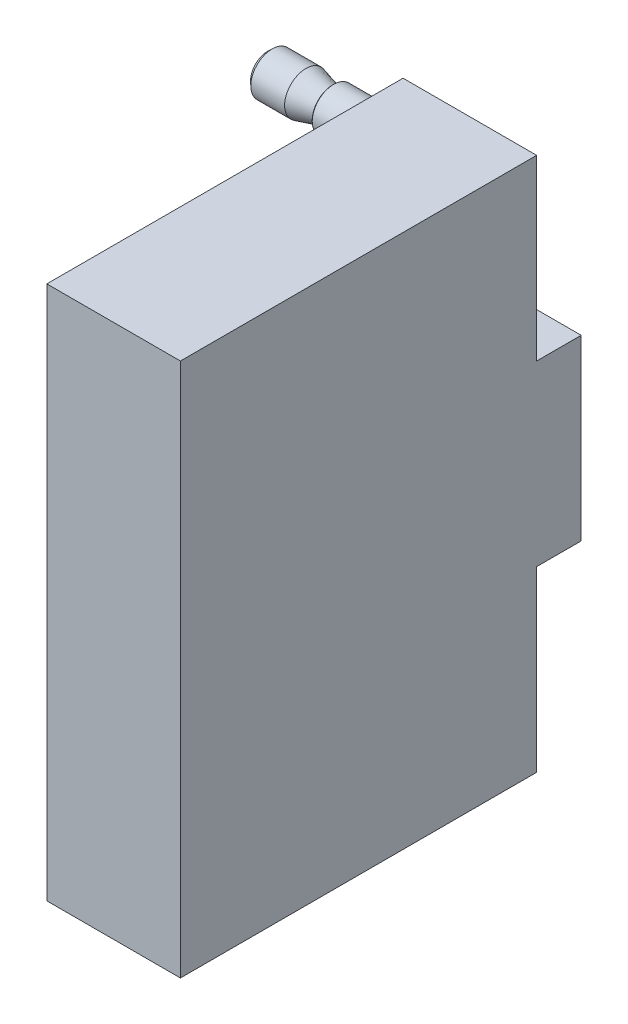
ISO-10303-21;
HEADER;
FILE_DESCRIPTION(('STEP AP214'),'2;1');
FILE_NAME('part.step','',(''),(''),'','','');
FILE_SCHEMA(('AUTOMOTIVE_DESIGN { 1 0 10303 214 1 1 1 1 }'));
ENDSEC;
DATA;
#1=APPLICATION_CONTEXT('core data for automotive mechanical design processes');
#2=APPLICATION_PROTOCOL_DEFINITION('international standard','automotive_design',2000,#1);
#3=PRODUCT_CONTEXT('',#1,'mechanical');
#4=PRODUCT('Part','Part','',(#3));
#5=PRODUCT_RELATED_PRODUCT_CATEGORY('part','',(#4));
#6=PRODUCT_DEFINITION_FORMATION('','',#4);
#7=PRODUCT_DEFINITION_CONTEXT('part definition',#1,'design');
#8=PRODUCT_DEFINITION('design','',#6,#7);
#9=PRODUCT_DEFINITION_SHAPE('','',#8);
#10=(LENGTH_UNIT() NAMED_UNIT(*) SI_UNIT(.MILLI.,.METRE.));
#11=(NAMED_UNIT(*) PLANE_ANGLE_UNIT() SI_UNIT($,.RADIAN.));
#12=(NAMED_UNIT(*) SI_UNIT($,.STERADIAN.) SOLID_ANGLE_UNIT());
#13=UNCERTAINTY_MEASURE_WITH_UNIT(LENGTH_MEASURE(1.E-05),#10,'distance_accuracy_value','');
#14=(GEOMETRIC_REPRESENTATION_CONTEXT(3) GLOBAL_UNCERTAINTY_ASSIGNED_CONTEXT((#13)) GLOBAL_UNIT_ASSIGNED_CONTEXT((#10,
#11,#12)) REPRESENTATION_CONTEXT('',''));
#15=CARTESIAN_POINT('',(0.,0.,0.));
#16=DIRECTION('',(0.,0.,1.));
#17=DIRECTION('',(1.,0.,0.));
#18=AXIS2_PLACEMENT_3D('',#15,#16,#17);
#19=CARTESIAN_POINT('',(-28.6839446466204,25.,1.9002106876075));
#20=DIRECTION('',(1.,0.,0.));
#21=DIRECTION('',(0.,1.,0.));
#22=AXIS2_PLACEMENT_3D('',#19,#20,#21);
#23=CONICAL_SURFACE('',#22,1.34162516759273,0.991977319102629);
#24=CARTESIAN_POINT('',(-28.6839446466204,25.,1.9002106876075));
#25=DIRECTION('',(1.,0.,0.));
#26=DIRECTION('',(0.,1.,0.));
#27=AXIS2_PLACEMENT_3D('',#24,#25,#26);
#28=CIRCLE('',#27,1.34162516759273);
#29=CARTESIAN_POINT('',(-28.6839446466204,26.3416251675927,1.9002106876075));
#30=VERTEX_POINT('',#29);
#31=EDGE_CURVE('E301',#30,#30,#28,.T.);
#32=ORIENTED_EDGE('',*,*,#31,.T.);
#33=EDGE_LOOP('',(#32));
#34=FACE_BOUND('',#33,.T.);
#35=CARTESIAN_POINT('',(-25.15191106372,18.5265609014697,0.));
#36=CARTESIAN_POINT('',(-25.2544568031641,18.690119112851,0.));
#37=CARTESIAN_POINT('',(-25.3567945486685,18.8538083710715,0.));
#38=CARTESIAN_POINT('',(-25.560917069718,19.1815403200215,0.));
#39=CARTESIAN_POINT('',(-25.6627018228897,19.3455830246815,0.));
#40=CARTESIAN_POINT('',(-25.8657664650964,19.6744131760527,0.));
#41=CARTESIAN_POINT('',(-25.9670450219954,19.839201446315,0.));
#42=CARTESIAN_POINT('',(-26.1686855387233,20.169331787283,0.));
#43=CARTESIAN_POINT('',(-26.2690475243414,20.3346738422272,0.));
#44=CARTESIAN_POINT('',(-26.4827361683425,20.6896316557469,0.));
#45=CARTESIAN_POINT('',(-26.5958788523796,20.8793584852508,0.));
#46=CARTESIAN_POINT('',(-26.8199167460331,21.2601620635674,0.));
#47=CARTESIAN_POINT('',(-26.9308117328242,21.4512389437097,0.));
#48=CARTESIAN_POINT('',(-27.1491405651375,21.8351309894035,0.));
#49=CARTESIAN_POINT('',(-27.2565776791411,22.0279442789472,0.));
#50=CARTESIAN_POINT('',(-27.4137169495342,22.3193144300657,0.));
#51=CARTESIAN_POINT('',(-27.4654235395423,22.4167887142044,0.));
#52=CARTESIAN_POINT('',(-27.5670981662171,22.612637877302,0.));
#53=CARTESIAN_POINT('',(-27.6170662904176,22.7110127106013,0.));
#54=CARTESIAN_POINT('',(-27.7049791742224,22.8891261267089,0.));
#55=CARTESIAN_POINT('',(-27.7433321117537,22.968662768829,0.));
#56=CARTESIAN_POINT('',(-27.8182108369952,23.1285975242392,0.));
#57=CARTESIAN_POINT('',(-27.8547365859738,23.2089956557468,0.));
#58=CARTESIAN_POINT('',(-27.9255155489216,23.3709076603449,0.));
#59=CARTESIAN_POINT('',(-27.9597659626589,23.4524227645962,0.));
#60=CARTESIAN_POINT('',(-28.0253036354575,23.6166444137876,0.));
#61=CARTESIAN_POINT('',(-28.0565909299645,23.6993509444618,0.));
#62=CARTESIAN_POINT('',(-28.1142915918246,23.8630449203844,0.));
#63=CARTESIAN_POINT('',(-28.1408419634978,23.9439835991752,0.));
#64=CARTESIAN_POINT('',(-28.1895109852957,24.1072073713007,0.));
#65=CARTESIAN_POINT('',(-28.211629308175,24.189492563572,0.));
#66=CARTESIAN_POINT('',(-28.2503349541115,24.3551459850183,0.));
#67=CARTESIAN_POINT('',(-28.2669367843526,24.4385107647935,0.));
#68=CARTESIAN_POINT('',(-28.2936529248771,24.6062533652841,0.));
#69=CARTESIAN_POINT('',(-28.3037705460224,24.6906306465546,0.));
#70=CARTESIAN_POINT('',(-28.3165443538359,24.8570999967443,0.));
#71=CARTESIAN_POINT('',(-28.3194404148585,24.9391732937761,0.));
#72=CARTESIAN_POINT('',(-28.3182429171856,25.103286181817,0.));
#73=CARTESIAN_POINT('',(-28.3141477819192,25.1853257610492,0.));
#74=CARTESIAN_POINT('',(-28.2991464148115,25.3502984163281,0.));
#75=CARTESIAN_POINT('',(-28.2881155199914,25.4332199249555,0.));
#76=CARTESIAN_POINT('',(-28.259925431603,25.597965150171,0.));
#77=CARTESIAN_POINT('',(-28.2427679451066,25.6797891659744,0.));
#78=CARTESIAN_POINT('',(-28.1895405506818,25.8989115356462,0.));
#79=CARTESIAN_POINT('',(-28.1486323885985,26.035026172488,0.));
#80=CARTESIAN_POINT('',(-28.0565914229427,26.303805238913,0.));
#81=CARTESIAN_POINT('',(-28.0054451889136,26.4364648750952,0.));
#82=CARTESIAN_POINT('',(-27.8959561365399,26.6997303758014,0.));
#83=CARTESIAN_POINT('',(-27.8375695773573,26.8303177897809,0.));
#84=CARTESIAN_POINT('',(-27.7161155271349,27.0891883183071,0.));
#85=CARTESIAN_POINT('',(-27.6530504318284,27.2174725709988,0.));
#86=CARTESIAN_POINT('',(-27.5274938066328,27.4647652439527,0.));
#87=CARTESIAN_POINT('',(-27.4651921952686,27.5838707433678,0.));
#88=CARTESIAN_POINT('',(-27.338453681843,27.8209571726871,0.));
#89=CARTESIAN_POINT('',(-27.2740164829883,27.9389379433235,0.));
#90=CARTESIAN_POINT('',(-27.1444746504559,28.1723618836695,0.));
#91=CARTESIAN_POINT('',(-27.0793921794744,28.2878173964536,0.));
#92=CARTESIAN_POINT('',(-26.9480410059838,28.5180120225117,0.));
#93=CARTESIAN_POINT('',(-26.8817726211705,28.6327513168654,0.));
#94=CARTESIAN_POINT('',(-26.8150715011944,28.7472339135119,0.));
#95=B_SPLINE_CURVE_WITH_KNOTS('',3,(#35,#36,#37,#38,#39,#40,#41,#42,#43,#44,#45,#46,#47,#48,#49,
#50,#51,#52,#53,#54,#55,#56,#57,#58,#59,#60,#61,#62,#63,#64,#65,#66,#67,#68,#69,#70,#71,#72,#73,
#74,#75,#76,#77,#78,#79,#80,#81,#82,#83,#84,#85,#86,#87,#88,#89,#90,#91,#92,#93,#94),
.UNSPECIFIED.,.F.,.F.,(4,2,2,2,2,2,2,2,2,2,2,2,2,2,2,2,2,2,2,2,2,2,2,2,2,2,2,2,2,4),(0.,
0.579139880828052,1.15830302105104,1.73857010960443,2.31882082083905,2.98151411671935,
3.64427279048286,4.30638541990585,4.63739156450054,4.96838101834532,5.23326542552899,
5.49815544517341,5.76336564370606,6.02857266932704,6.28401860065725,6.53948338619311,
6.79427093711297,7.04892828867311,7.29500689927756,7.54114100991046,7.79183079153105,
8.04245077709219,8.46817320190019,8.89445779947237,9.32345613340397,9.7522362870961,
10.155455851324,10.5587316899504,10.9563309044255,11.353825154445),.UNSPECIFIED.);
#96=CARTESIAN_POINT('',(-28.3067449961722,24.7332646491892,0.));
#97=VERTEX_POINT('',#96);
#98=CARTESIAN_POINT('',(-28.3067449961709,25.2667353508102,0.));
#99=VERTEX_POINT('',#98);
#100=EDGE_CURVE('E211',#97,#99,#95,.T.);
#101=ORIENTED_EDGE('',*,*,#100,.F.);
#102=CARTESIAN_POINT('',(-28.3067449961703,25.,1.9002106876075));
#103=DIRECTION('',(1.,0.,0.));
#104=DIRECTION('',(0.,1.,0.));
#105=AXIS2_PLACEMENT_3D('',#102,#103,#104);
#106=CIRCLE('',#105,1.91884038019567);
#107=EDGE_CURVE('E298',#99,#97,#106,.T.);
#108=ORIENTED_EDGE('',*,*,#107,.F.);
#109=EDGE_LOOP('',(#101,#108));
#110=FACE_BOUND('',#109,.T.);
#111=ADVANCED_FACE('F14',(#34,#110),#23,.T.);
#112=CARTESIAN_POINT('',(-28.3067449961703,25.,1.9002106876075));
#113=DIRECTION('',(1.,0.,0.));
#114=DIRECTION('',(0.,1.,0.));
#115=AXIS2_PLACEMENT_3D('',#112,#113,#114);
#116=CONICAL_SURFACE('',#115,1.91884038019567,0.760039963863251);
#117=CARTESIAN_POINT('',(-25.8429668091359,21.1864695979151,0.));
#118=CARTESIAN_POINT('',(-25.9244437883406,21.2730101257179,0.));
#119=CARTESIAN_POINT('',(-26.0056415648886,21.3598158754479,0.));
#120=CARTESIAN_POINT('',(-26.1673305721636,21.5340976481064,0.));
#121=CARTESIAN_POINT('',(-26.2478217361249,21.6215737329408,0.));
#122=CARTESIAN_POINT('',(-26.4082386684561,21.7976541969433,0.));
#123=CARTESIAN_POINT('',(-26.4881611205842,21.8862616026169,0.));
#124=CARTESIAN_POINT('',(-26.646902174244,22.0644545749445,0.));
#125=CARTESIAN_POINT('',(-26.7257208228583,22.1540400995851,0.));
#126=CARTESIAN_POINT('',(-26.8862389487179,22.3393719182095,0.));
#127=CARTESIAN_POINT('',(-26.9678595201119,22.4351867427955,0.));
#128=CARTESIAN_POINT('',(-27.1290378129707,22.6285344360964,0.));
#129=CARTESIAN_POINT('',(-27.2085956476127,22.7260672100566,0.));
#130=CARTESIAN_POINT('',(-27.3647943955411,22.9232069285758,0.));
#131=CARTESIAN_POINT('',(-27.4414396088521,23.0228104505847,0.));
#132=CARTESIAN_POINT('',(-27.5908182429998,23.2248944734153,0.));
#133=CARTESIAN_POINT('',(-27.6635528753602,23.3273740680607,0.));
#134=CARTESIAN_POINT('',(-27.7826268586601,23.5052016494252,0.));
#135=CARTESIAN_POINT('',(-27.8303984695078,23.5795855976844,0.));
#136=CARTESIAN_POINT('',(-27.9222269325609,23.7306698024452,0.));
#137=CARTESIAN_POINT('',(-27.9662824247,23.8073708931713,0.));
#138=CARTESIAN_POINT('',(-28.0490653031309,23.9629041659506,0.));
#139=CARTESIAN_POINT('',(-28.0878300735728,24.0417161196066,0.));
#140=CARTESIAN_POINT('',(-28.1586730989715,24.2022432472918,0.));
#141=CARTESIAN_POINT('',(-28.190756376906,24.2839561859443,0.));
#142=CARTESIAN_POINT('',(-28.2533239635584,24.4723128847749,0.));
#143=CARTESIAN_POINT('',(-28.2811927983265,24.5798850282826,0.));
#144=CARTESIAN_POINT('',(-28.3089967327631,24.7434003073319,0.));
#145=CARTESIAN_POINT('',(-28.3159315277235,24.798187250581,0.));
#146=CARTESIAN_POINT('',(-28.324840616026,24.9081757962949,0.));
#147=CARTESIAN_POINT('',(-28.326815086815,24.9633773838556,0.));
#148=CARTESIAN_POINT('',(-28.3256816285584,25.0738599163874,0.));
#149=CARTESIAN_POINT('',(-28.3225613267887,25.1291407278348,0.));
#150=CARTESIAN_POINT('',(-28.3113924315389,25.2391974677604,0.));
#151=CARTESIAN_POINT('',(-28.3033435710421,25.2939733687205,0.));
#152=CARTESIAN_POINT('',(-28.2826932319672,25.4028484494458,0.));
#153=CARTESIAN_POINT('',(-28.2700758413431,25.4569445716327,0.));
#154=CARTESIAN_POINT('',(-28.2408458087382,25.5640343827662,0.));
#155=CARTESIAN_POINT('',(-28.224232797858,25.6170279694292,0.));
#156=CARTESIAN_POINT('',(-28.1667947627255,25.7813574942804,0.));
#157=CARTESIAN_POINT('',(-28.1199051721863,25.8905765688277,0.));
#158=CARTESIAN_POINT('',(-28.0156353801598,26.1038986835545,0.));
#159=CARTESIAN_POINT('',(-27.9582363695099,26.2079921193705,0.));
#160=CARTESIAN_POINT('',(-27.8355616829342,26.4134254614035,0.));
#161=CARTESIAN_POINT('',(-27.7701841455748,26.5147038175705,0.));
#162=CARTESIAN_POINT('',(-27.6684658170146,26.6640273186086,0.));
#163=CARTESIAN_POINT('',(-27.6339650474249,26.7133509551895,0.));
#164=CARTESIAN_POINT('',(-27.5639258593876,26.8112544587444,0.));
#165=CARTESIAN_POINT('',(-27.5283874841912,26.8598343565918,0.));
#166=CARTESIAN_POINT('',(-27.4096284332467,27.0191562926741,0.));
#167=CARTESIAN_POINT('',(-27.3245485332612,27.1285116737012,0.));
#168=CARTESIAN_POINT('',(-27.1512190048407,27.3446893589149,0.));
#169=CARTESIAN_POINT('',(-27.0629687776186,27.4515111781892,0.));
#170=CARTESIAN_POINT('',(-26.8841368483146,27.6632835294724,0.));
#171=CARTESIAN_POINT('',(-26.7935538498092,27.7682329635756,0.));
#172=CARTESIAN_POINT('',(-26.6106853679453,27.976640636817,0.));
#173=CARTESIAN_POINT('',(-26.5183998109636,28.0800988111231,0.));
#174=CARTESIAN_POINT('',(-26.2391326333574,28.38927755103,0.));
#175=CARTESIAN_POINT('',(-26.0502163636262,28.5932483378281,0.));
#176=CARTESIAN_POINT('',(-25.6692973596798,28.9981339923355,0.));
#177=CARTESIAN_POINT('',(-25.4772957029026,29.1990498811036,0.));
#178=CARTESIAN_POINT('',(-25.1148034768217,29.5743776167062,0.));
#179=CARTESIAN_POINT('',(-24.9445556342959,29.7490242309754,0.));
#180=CARTESIAN_POINT('',(-24.6028571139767,30.097170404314,0.));
#181=CARTESIAN_POINT('',(-24.4314063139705,30.2706698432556,0.));
#182=CARTESIAN_POINT('',(-24.0884730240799,30.6159275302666,0.));
#183=CARTESIAN_POINT('',(-23.9169949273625,30.7876901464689,0.));
#184=CARTESIAN_POINT('',(-23.5733724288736,31.1305054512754,0.));
#185=CARTESIAN_POINT('',(-23.4012281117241,31.3015582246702,0.));
#186=CARTESIAN_POINT('',(-23.2288350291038,31.4723583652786,0.));
#187=B_SPLINE_CURVE_WITH_KNOTS('',3,(#117,#118,#119,#120,#121,#122,#123,#124,#125,#126,#127,
#128,#129,#130,#131,#132,#133,#134,#135,#136,#137,#138,#139,#140,#141,#142,#143,#144,#145,#146,
#147,#148,#149,#150,#151,#152,#153,#154,#155,#156,#157,#158,#159,#160,#161,#162,#163,#164,#165,
#166,#167,#168,#169,#170,#171,#172,#173,#174,#175,#176,#177,#178,#179,#180,#181,#182,#183,#184,
#185,#186),.UNSPECIFIED.,.F.,.F.,(4,2,2,2,2,2,2,2,2,2,2,2,2,2,2,2,2,2,2,2,2,2,2,2,2,2,2,2,2,2,2,
2,2,2,4),(0.,0.356582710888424,0.713198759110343,1.07117159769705,1.42912912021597,
1.80670766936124,2.18426545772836,2.5612422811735,2.9381016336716,3.20322948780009,
3.46845395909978,3.73169484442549,3.99473711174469,4.3266138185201,4.49209268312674,
4.65756562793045,4.82344102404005,4.98932540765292,5.15579320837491,5.32227638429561,
5.67789990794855,6.03416624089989,6.39558226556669,6.57615103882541,6.7567122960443,
7.17227707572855,7.58792076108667,8.00380064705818,8.41969855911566,9.25368457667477,
10.0873854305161,10.8190687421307,11.5508274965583,12.2789491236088,13.0069811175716),.UNSPECIFIED.);
#188=CARTESIAN_POINT('',(-27.8004213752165,23.5337970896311,0.));
#189=VERTEX_POINT('',#188);
#190=EDGE_CURVE('E215',#189,#97,#187,.T.);
#191=ORIENTED_EDGE('',*,*,#190,.F.);
#192=CARTESIAN_POINT('',(-27.8004213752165,25.,1.9002106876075));
#193=DIRECTION('',(1.,0.,0.));
#194=DIRECTION('',(0.,1.,0.));
#195=AXIS2_PLACEMENT_3D('',#192,#193,#194);
#196=CIRCLE('',#195,2.40011492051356);
#197=CARTESIAN_POINT('',(-27.8004213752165,26.4662029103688,0.));
#198=VERTEX_POINT('',#197);
#199=EDGE_CURVE('E295',#198,#189,#196,.T.);
#200=ORIENTED_EDGE('',*,*,#199,.F.);
#201=EDGE_CURVE('E623',#99,#198,#187,.T.);
#202=ORIENTED_EDGE('',*,*,#201,.F.);
#203=ORIENTED_EDGE('',*,*,#107,.T.);
#204=EDGE_LOOP('',(#191,#200,#202,#203));
#205=FACE_BOUND('',#204,.T.);
#206=ADVANCED_FACE('F507',(#205),#116,.T.);
#207=CARTESIAN_POINT('',(-14.9999999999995,25.,1.9002106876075));
#208=DIRECTION('',(1.,0.,0.));
#209=DIRECTION('',(0.,1.,0.));
#210=AXIS2_PLACEMENT_3D('',#207,#208,#209);
#211=CYLINDRICAL_SURFACE('',#210,2.40011492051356);
#212=DIRECTION('',(1.,0.,0.));
#213=VECTOR('',#212,1.);
#214=CARTESIAN_POINT('',(-14.9999999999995,26.4662029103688,0.));
#215=LINE('',#214,#213);
#216=CARTESIAN_POINT('',(-24.0005746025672,26.4662029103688,0.));
#217=VERTEX_POINT('',#216);
#218=EDGE_CURVE('E35',#198,#217,#215,.T.);
#219=ORIENTED_EDGE('',*,*,#218,.F.);
#220=ORIENTED_EDGE('',*,*,#199,.T.);
#221=DIRECTION('',(1.,0.,0.));
#222=VECTOR('',#221,1.);
#223=CARTESIAN_POINT('',(-14.9999999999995,23.5337970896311,0.));
#224=LINE('',#223,#222);
#225=CARTESIAN_POINT('',(-24.0005746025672,23.5337970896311,0.));
#226=VERTEX_POINT('',#225);
#227=EDGE_CURVE('E592',#226,#189,#224,.F.);
#228=ORIENTED_EDGE('',*,*,#227,.F.);
#229=CARTESIAN_POINT('',(-24.0005746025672,25.,1.9002106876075));
#230=DIRECTION('',(1.,0.,0.));
#231=DIRECTION('',(0.,1.,0.));
#232=AXIS2_PLACEMENT_3D('',#229,#230,#231);
#233=CIRCLE('',#232,2.40011492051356);
#234=EDGE_CURVE('E292',#217,#226,#233,.T.);
#235=ORIENTED_EDGE('',*,*,#234,.F.);
#236=EDGE_LOOP('',(#219,#220,#228,#235));
#237=FACE_BOUND('',#236,.T.);
#238=ADVANCED_FACE('F513',(#237),#211,.T.);
#239=CARTESIAN_POINT('',(-24.0005746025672,25.,1.9002106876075));
#240=DIRECTION('',(-1.,0.,0.));
#241=DIRECTION('',(0.,-1.,0.));
#242=AXIS2_PLACEMENT_3D('',#239,#240,#241);
#243=CONICAL_SURFACE('',#242,2.40011492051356,0.261760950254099);
#244=CARTESIAN_POINT('',(-21.3775138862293,25.,1.9002106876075));
#245=DIRECTION('',(1.,0.,0.));
#246=DIRECTION('',(0.,1.,0.));
#247=AXIS2_PLACEMENT_3D('',#244,#245,#246);
#248=CIRCLE('',#247,1.69737598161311);
#249=CARTESIAN_POINT('',(-21.3775138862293,26.6973759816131,1.9002106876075));
#250=VERTEX_POINT('',#249);
#251=EDGE_CURVE('E289',#250,#250,#248,.T.);
#252=ORIENTED_EDGE('',*,*,#251,.F.);
#253=EDGE_LOOP('',(#252));
#254=FACE_BOUND('',#253,.T.);
#255=CARTESIAN_POINT('',(-26.9489185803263,22.4377161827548,0.));
#256=CARTESIAN_POINT('',(-26.8052997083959,22.4856277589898,0.));
#257=CARTESIAN_POINT('',(-26.6618174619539,22.5339535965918,0.));
#258=CARTESIAN_POINT('',(-26.375190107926,22.6316250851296,0.));
#259=CARTESIAN_POINT('',(-26.2320450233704,22.6809708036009,0.));
#260=CARTESIAN_POINT('',(-25.9458405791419,22.7809838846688,0.));
#261=CARTESIAN_POINT('',(-25.8027822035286,22.8316540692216,0.));
#262=CARTESIAN_POINT('',(-25.5171990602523,22.9344652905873,0.));
#263=CARTESIAN_POINT('',(-25.37467427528,22.9866062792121,0.));
#264=CARTESIAN_POINT('',(-25.0903534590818,23.0926896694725,0.));
#265=CARTESIAN_POINT('',(-24.9485571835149,23.1466314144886,0.));
#266=CARTESIAN_POINT('',(-24.6658617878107,23.2568144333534,0.));
#267=CARTESIAN_POINT('',(-24.5249626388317,23.3130556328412,0.));
#268=CARTESIAN_POINT('',(-24.2445230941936,23.4284834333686,0.));
#269=CARTESIAN_POINT('',(-24.1049815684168,23.4876672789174,0.));
#270=CARTESIAN_POINT('',(-23.8276830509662,23.6100585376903,0.));
#271=CARTESIAN_POINT('',(-23.6899256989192,23.67326512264,0.));
#272=CARTESIAN_POINT('',(-23.5019114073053,23.7643878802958,0.));
#273=CARTESIAN_POINT('',(-23.4504591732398,23.789835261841,0.));
#274=CARTESIAN_POINT('',(-23.3480488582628,23.8417108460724,0.));
#275=CARTESIAN_POINT('',(-23.2970908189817,23.8681391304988,0.));
#276=CARTESIAN_POINT('',(-23.1448063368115,23.9492876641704,0.));
#277=CARTESIAN_POINT('',(-23.0443691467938,24.005728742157,0.));
#278=CARTESIAN_POINT('',(-22.8970267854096,24.095193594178,0.));
#279=CARTESIAN_POINT('',(-22.8486046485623,24.1257174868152,0.));
#280=CARTESIAN_POINT('',(-22.7531191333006,24.1888121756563,0.));
#281=CARTESIAN_POINT('',(-22.7060553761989,24.2213823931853,0.));
#282=CARTESIAN_POINT('',(-22.6139846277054,24.2889782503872,0.));
#283=CARTESIAN_POINT('',(-22.5689705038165,24.3239940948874,0.));
#284=CARTESIAN_POINT('',(-22.4817133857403,24.3972933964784,0.));
#285=CARTESIAN_POINT('',(-22.4394671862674,24.4355729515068,0.));
#286=CARTESIAN_POINT('',(-22.3706621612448,24.5049212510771,0.));
#287=CARTESIAN_POINT('',(-22.3430593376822,24.5349437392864,0.));
#288=CARTESIAN_POINT('',(-22.2909410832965,24.5976912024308,0.));
#289=CARTESIAN_POINT('',(-22.266430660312,24.6304204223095,0.));
#290=CARTESIAN_POINT('',(-22.2216794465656,24.6994074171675,0.));
#291=CARTESIAN_POINT('',(-22.2015026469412,24.7357078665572,0.));
#292=CARTESIAN_POINT('',(-22.1681225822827,24.8113664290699,0.));
#293=CARTESIAN_POINT('',(-22.1548910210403,24.8507113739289,0.));
#294=CARTESIAN_POINT('',(-22.1401198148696,24.9198153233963,0.));
#295=CARTESIAN_POINT('',(-22.136315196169,24.9490870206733,0.));
#296=CARTESIAN_POINT('',(-22.1338345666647,25.007857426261,0.));
#297=CARTESIAN_POINT('',(-22.1351581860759,25.0373561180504,0.));
#298=CARTESIAN_POINT('',(-22.1427587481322,25.0955935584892,0.));
#299=CARTESIAN_POINT('',(-22.1490203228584,25.1243343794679,0.));
#300=CARTESIAN_POINT('',(-22.1657871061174,25.1805268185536,0.));
#301=CARTESIAN_POINT('',(-22.1762945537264,25.2079777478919,0.));
#302=CARTESIAN_POINT('',(-22.2085386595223,25.278477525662,0.));
#303=CARTESIAN_POINT('',(-22.2331503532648,25.3201972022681,0.));
#304=CARTESIAN_POINT('',(-22.2882616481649,25.399573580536,0.));
#305=CARTESIAN_POINT('',(-22.3187845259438,25.4372132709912,0.));
#306=CARTESIAN_POINT('',(-22.39551891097,25.5223080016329,0.));
#307=CARTESIAN_POINT('',(-22.443365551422,25.5682652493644,0.));
#308=CARTESIAN_POINT('',(-22.5431923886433,25.6555100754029,0.));
#309=CARTESIAN_POINT('',(-22.595181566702,25.6967870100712,0.));
#310=CARTESIAN_POINT('',(-22.7024179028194,25.7762983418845,0.));
#311=CARTESIAN_POINT('',(-22.7576975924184,25.8144884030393,0.));
#312=CARTESIAN_POINT('',(-22.8699810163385,25.8880613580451,0.));
#313=CARTESIAN_POINT('',(-22.9269826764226,25.9234474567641,0.));
#314=CARTESIAN_POINT('',(-23.052068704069,25.997904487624,0.));
#315=CARTESIAN_POINT('',(-23.1203884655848,26.0365778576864,0.));
#316=CARTESIAN_POINT('',(-23.2582754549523,26.1116425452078,0.));
#317=CARTESIAN_POINT('',(-23.3278429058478,26.1480334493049,0.));
#318=CARTESIAN_POINT('',(-23.5380001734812,26.2545488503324,0.));
#319=CARTESIAN_POINT('',(-23.6799587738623,26.3219666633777,0.));
#320=CARTESIAN_POINT('',(-23.9665614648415,26.4521837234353,0.));
#321=CARTESIAN_POINT('',(-24.1112134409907,26.5149652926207,0.));
#322=CARTESIAN_POINT('',(-24.4019392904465,26.6369726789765,0.));
#323=CARTESIAN_POINT('',(-24.548012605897,26.6961998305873,0.));
#324=CARTESIAN_POINT('',(-24.8240709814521,26.8052321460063,0.));
#325=CARTESIAN_POINT('',(-24.9539413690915,26.85532955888,0.));
#326=CARTESIAN_POINT('',(-25.2143243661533,26.9538693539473,0.));
#327=CARTESIAN_POINT('',(-25.3448370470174,27.0023115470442,0.));
#328=CARTESIAN_POINT('',(-25.605421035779,27.0975020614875,0.));
#329=CARTESIAN_POINT('',(-25.7354888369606,27.1442600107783,0.));
#330=CARTESIAN_POINT('',(-25.9959998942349,27.2366487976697,0.));
#331=CARTESIAN_POINT('',(-26.1264430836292,27.2822798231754,0.));
#332=CARTESIAN_POINT('',(-26.2570407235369,27.3274583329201,0.));
#333=B_SPLINE_CURVE_WITH_KNOTS('',3,(#255,#256,#257,#258,#259,#260,#261,#262,#263,#264,#265,
#266,#267,#268,#269,#270,#271,#272,#273,#274,#275,#276,#277,#278,#279,#280,#281,#282,#283,#284,
#285,#286,#287,#288,#289,#290,#291,#292,#293,#294,#295,#296,#297,#298,#299,#300,#301,#302,#303,
#304,#305,#306,#307,#308,#309,#310,#311,#312,#313,#314,#315,#316,#317,#318,#319,#320,#321,#322,
#323,#324,#325,#326,#327,#328,#329,#330,#331,#332),.UNSPECIFIED.,.F.,.F.,(4,2,2,2,2,2,2,2,2,2,2,
2,2,2,2,2,2,2,2,2,2,2,2,2,2,2,2,2,2,2,2,2,2,2,2,2,2,2,4),(0.,0.454201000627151,
0.908432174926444,1.36372604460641,1.81900501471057,2.27411974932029,2.72921977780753,
3.18390139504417,3.63848969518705,3.81068310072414,3.98289088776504,4.32830172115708,
4.49998452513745,4.67161899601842,4.8426016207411,5.01338261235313,5.13558373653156,
5.25798028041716,5.38207585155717,5.50566183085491,5.59380081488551,5.68193344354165,
5.76979286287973,5.85769867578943,6.00216838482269,6.1472189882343,6.34574962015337,
6.54472304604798,6.7461765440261,6.94739636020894,7.18285547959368,7.41835711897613,
7.88965781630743,8.36267155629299,8.83550658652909,9.25308792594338,9.67071681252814,
10.0853624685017,10.4999385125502),.UNSPECIFIED.);
#334=EDGE_CURVE('E589',#217,#226,#333,.F.);
#335=ORIENTED_EDGE('',*,*,#334,.F.);
#336=ORIENTED_EDGE('',*,*,#234,.T.);
#337=EDGE_LOOP('',(#335,#336));
#338=FACE_BOUND('',#337,.T.);
#339=ADVANCED_FACE('F608',(#254,#338),#243,.T.);
#340=CARTESIAN_POINT('',(-21.0235946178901,25.,1.9002106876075));
#341=DIRECTION('',(1.,0.,0.));
#342=DIRECTION('',(0.,1.,0.));
#343=AXIS2_PLACEMENT_3D('',#340,#341,#342);
#344=CONICAL_SURFACE('',#343,1.8702954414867,1.37127084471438);
#345=CARTESIAN_POINT('',(-21.0235946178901,25.,1.9002106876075));
#346=DIRECTION('',(1.,0.,0.));
#347=DIRECTION('',(0.,1.,0.));
#348=AXIS2_PLACEMENT_3D('',#345,#346,#347);
#349=CIRCLE('',#348,1.8702954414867);
#350=CARTESIAN_POINT('',(-21.0235946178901,26.8702954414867,1.9002106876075));
#351=VERTEX_POINT('',#350);
#352=EDGE_CURVE('E277',#351,#351,#349,.T.);
#353=ORIENTED_EDGE('',*,*,#352,.T.);
#354=EDGE_LOOP('',(#353));
#355=FACE_BOUND('',#354,.T.);
#356=CARTESIAN_POINT('',(-20.7191824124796,22.2099480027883,0.));
#357=CARTESIAN_POINT('',(-20.7334022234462,22.2950421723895,0.));
#358=CARTESIAN_POINT('',(-20.7474266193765,22.3801690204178,0.));
#359=CARTESIAN_POINT('',(-20.7749869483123,22.5505041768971,0.));
#360=CARTESIAN_POINT('',(-20.7885228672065,22.6357124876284,0.));
#361=CARTESIAN_POINT('',(-20.8282737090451,22.8916275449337,0.));
#362=CARTESIAN_POINT('',(-20.853606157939,23.0624735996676,0.));
#363=CARTESIAN_POINT('',(-20.9005638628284,23.4035386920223,0.));
#364=CARTESIAN_POINT('',(-20.9222124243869,23.5737544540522,0.));
#365=CARTESIAN_POINT('',(-20.9602262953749,23.914731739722,0.));
#366=CARTESIAN_POINT('',(-20.9765935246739,24.0854930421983,0.));
#367=CARTESIAN_POINT('',(-21.001833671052,24.4284506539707,0.));
#368=CARTESIAN_POINT('',(-21.0106695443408,24.6006498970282,0.));
#369=CARTESIAN_POINT('',(-21.016883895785,24.859128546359,0.));
#370=CARTESIAN_POINT('',(-21.0177817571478,24.9453294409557,0.));
#371=CARTESIAN_POINT('',(-21.0172030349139,25.117721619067,0.));
#372=CARTESIAN_POINT('',(-21.0157264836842,25.2039129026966,0.));
#373=CARTESIAN_POINT('',(-21.0077980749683,25.463400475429,0.));
#374=CARTESIAN_POINT('',(-20.9978239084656,25.6365967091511,0.));
#375=CARTESIAN_POINT('',(-20.977286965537,25.8959188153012,0.));
#376=CARTESIAN_POINT('',(-20.9695110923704,25.9822885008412,0.));
#377=CARTESIAN_POINT('',(-20.9524005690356,26.1548576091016,0.));
#378=CARTESIAN_POINT('',(-20.9430662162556,26.2410570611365,0.));
#379=CARTESIAN_POINT('',(-20.9331010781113,26.3271840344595,0.));
#380=B_SPLINE_CURVE_WITH_KNOTS('',3,(#356,#357,#358,#359,#360,#361,#362,#363,#364,#365,#366,
#367,#368,#369,#370,#371,#372,#373,#374,#375,#376,#377,#378,#379),.UNSPECIFIED.,.F.,.F.,(4,2,2,
2,2,2,2,2,2,2,2,4),(0.,0.258821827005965,0.517651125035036,1.03576859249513,1.55047545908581,
2.06499500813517,2.58203090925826,2.84061707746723,3.09919972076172,3.61940295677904,
3.87955103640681,4.13964953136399),.UNSPECIFIED.);
#381=CARTESIAN_POINT('',(-21.0000000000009,24.4192490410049,0.));
#382=VERTEX_POINT('',#381);
#383=CARTESIAN_POINT('',(-21.0000000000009,25.5807509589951,0.));
#384=VERTEX_POINT('',#383);
#385=EDGE_CURVE('E900',#382,#384,#380,.T.);
#386=ORIENTED_EDGE('',*,*,#385,.F.);
#387=CARTESIAN_POINT('',(-21.0000000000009,25.,1.9002106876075));
#388=DIRECTION('',(1.,0.,0.));
#389=DIRECTION('',(0.,1.,0.));
#390=AXIS2_PLACEMENT_3D('',#387,#388,#389);
#391=CIRCLE('',#390,1.98697567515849);
#392=EDGE_CURVE('E274',#384,#382,#391,.T.);
#393=ORIENTED_EDGE('',*,*,#392,.F.);
#394=EDGE_LOOP('',(#386,#393));
#395=FACE_BOUND('',#394,.T.);
#396=ADVANCED_FACE('F612',(#355,#395),#344,.T.);
#397=CARTESIAN_POINT('',(-21.0000000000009,25.,3.88718636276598));
#398=DIRECTION('',(1.,0.,0.));
#399=DIRECTION('',(0.,1.,0.));
#400=AXIS2_PLACEMENT_3D('',#397,#398,#399);
#401=PLANE('',#400);
#402=DIRECTION('',(0.,1.,0.));
#403=VECTOR('',#402,1.);
#404=CARTESIAN_POINT('',(-21.0000000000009,25.,0.));
#405=LINE('',#404,#403);
#406=CARTESIAN_POINT('',(-21.0000000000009,23.7039228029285,0.));
#407=VERTEX_POINT('',#406);
#408=EDGE_CURVE('E594',#407,#382,#405,.T.);
#409=ORIENTED_EDGE('',*,*,#408,.F.);
#410=CARTESIAN_POINT('',(-21.0000000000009,25.,1.9002106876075));
#411=DIRECTION('',(1.,0.,0.));
#412=DIRECTION('',(0.,1.,0.));
#413=AXIS2_PLACEMENT_3D('',#410,#411,#412);
#414=CIRCLE('',#413,2.30013407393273);
#415=CARTESIAN_POINT('',(-21.0000000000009,26.2960771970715,0.));
#416=VERTEX_POINT('',#415);
#417=EDGE_CURVE('E271',#416,#407,#414,.T.);
#418=ORIENTED_EDGE('',*,*,#417,.F.);
#419=EDGE_CURVE('E906',#384,#416,#405,.T.);
#420=ORIENTED_EDGE('',*,*,#419,.F.);
#421=ORIENTED_EDGE('',*,*,#392,.T.);
#422=EDGE_LOOP('',(#409,#418,#420,#421));
#423=FACE_BOUND('',#422,.T.);
#424=ADVANCED_FACE('F859',(#423),#401,.F.);
#425=CARTESIAN_POINT('',(-21.0000000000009,25.,1.9002106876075));
#426=DIRECTION('',(1.,0.,0.));
#427=DIRECTION('',(0.,1.,0.));
#428=AXIS2_PLACEMENT_3D('',#425,#426,#427);
#429=CONICAL_SURFACE('',#428,2.30013407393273,0.785398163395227);
#430=CARTESIAN_POINT('',(-18.8839939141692,21.0135864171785,0.));
#431=CARTESIAN_POINT('',(-18.9679194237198,21.1065728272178,0.));
#432=CARTESIAN_POINT('',(-19.0515597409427,21.199818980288,0.));
#433=CARTESIAN_POINT('',(-19.2181116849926,21.3869739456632,0.));
#434=CARTESIAN_POINT('',(-19.301023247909,21.4808828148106,0.));
#435=CARTESIAN_POINT('',(-19.466148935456,21.6697238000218,0.));
#436=CARTESIAN_POINT('',(-19.5483608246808,21.7646578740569,0.));
#437=CARTESIAN_POINT('',(-19.7116367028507,21.955503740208,0.));
#438=CARTESIAN_POINT('',(-19.7927007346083,22.0514154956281,0.));
#439=CARTESIAN_POINT('',(-19.9519201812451,22.2427368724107,0.));
#440=CARTESIAN_POINT('',(-20.0301016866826,22.3381247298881,0.));
#441=CARTESIAN_POINT('',(-20.1846091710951,22.5303901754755,0.));
#442=CARTESIAN_POINT('',(-20.2609352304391,22.6272676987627,0.));
#443=CARTESIAN_POINT('',(-20.4110649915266,22.8228797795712,0.));
#444=CARTESIAN_POINT('',(-20.4848700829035,22.9216132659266,0.));
#445=CARTESIAN_POINT('',(-20.6290622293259,23.121534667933,0.));
#446=CARTESIAN_POINT('',(-20.6994500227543,23.2227220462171,0.));
#447=CARTESIAN_POINT('',(-20.8218843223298,23.4079152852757,0.));
#448=CARTESIAN_POINT('',(-20.8747978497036,23.4913439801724,0.));
#449=CARTESIAN_POINT('',(-20.9763413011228,23.660670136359,0.));
#450=CARTESIAN_POINT('',(-21.0249756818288,23.7465649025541,0.));
#451=CARTESIAN_POINT('',(-21.1167587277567,23.9220576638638,0.));
#452=CARTESIAN_POINT('',(-21.1598674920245,24.0116770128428,0.));
#453=CARTESIAN_POINT('',(-21.2184381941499,24.1489010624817,0.));
#454=CARTESIAN_POINT('',(-21.2369737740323,24.1951928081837,0.));
#455=CARTESIAN_POINT('',(-21.2716256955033,24.2887102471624,0.));
#456=CARTESIAN_POINT('',(-21.2877401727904,24.3359366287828,0.));
#457=CARTESIAN_POINT('',(-21.3024541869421,24.3836200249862,0.));
#458=B_SPLINE_CURVE_WITH_KNOTS('',3,(#430,#431,#432,#433,#434,#435,#436,#437,#438,#439,#440,
#441,#442,#443,#444,#445,#446,#447,#448,#449,#450,#451,#452,#453,#454,#455,#456,#457),
.UNSPECIFIED.,.F.,.F.,(4,2,2,2,2,2,2,2,2,2,2,2,2,4),(0.,0.375780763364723,0.751594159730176,
1.1283381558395,1.50506806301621,1.87505180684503,2.2450194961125,2.61477984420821,
2.9844599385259,3.28074749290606,3.57672272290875,3.87472739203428,4.02426084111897,
4.17390885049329),.UNSPECIFIED.);
#459=CARTESIAN_POINT('',(-20.9000191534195,23.5337970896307,0.));
#460=VERTEX_POINT('',#459);
#461=EDGE_CURVE('E590',#460,#407,#458,.T.);
#462=ORIENTED_EDGE('',*,*,#461,.F.);
#463=CARTESIAN_POINT('',(-20.9000191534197,25.,1.9002106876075));
#464=DIRECTION('',(1.,0.,0.));
#465=DIRECTION('',(0.,1.,0.));
#466=AXIS2_PLACEMENT_3D('',#463,#464,#465);
#467=CIRCLE('',#466,2.40011492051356);
#468=CARTESIAN_POINT('',(-20.9000191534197,26.4662029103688,0.));
#469=VERTEX_POINT('',#468);
#470=EDGE_CURVE('E268',#469,#460,#467,.T.);
#471=ORIENTED_EDGE('',*,*,#470,.F.);
#472=CARTESIAN_POINT('',(-21.3024541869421,25.6163799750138,0.));
#473=CARTESIAN_POINT('',(-21.287740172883,25.6640633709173,0.));
#474=CARTESIAN_POINT('',(-21.271625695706,25.7112897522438,0.));
#475=CARTESIAN_POINT('',(-21.2369737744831,25.8048071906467,0.));
#476=CARTESIAN_POINT('',(-21.2184381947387,25.8510989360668,0.));
#477=CARTESIAN_POINT('',(-21.1598674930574,25.9883229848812,0.));
#478=CARTESIAN_POINT('',(-21.1167587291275,26.0779423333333,0.));
#479=CARTESIAN_POINT('',(-21.0249756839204,26.2534350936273,0.));
#480=CARTESIAN_POINT('',(-20.9763413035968,26.3393298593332,0.));
#481=CARTESIAN_POINT('',(-20.8747978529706,26.508656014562,0.));
#482=CARTESIAN_POINT('',(-20.8218843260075,26.5920847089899,0.));
#483=CARTESIAN_POINT('',(-20.6994500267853,26.7772779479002,0.));
#484=CARTESIAN_POINT('',(-20.6290622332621,26.878465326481,0.));
#485=CARTESIAN_POINT('',(-20.4848700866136,27.0783867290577,0.));
#486=CARTESIAN_POINT('',(-20.4110649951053,27.1771202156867,0.));
#487=CARTESIAN_POINT('',(-20.2609352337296,27.372732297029,0.));
#488=CARTESIAN_POINT('',(-20.1846091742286,27.4696098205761,0.));
#489=CARTESIAN_POINT('',(-20.0301016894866,27.6618752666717,0.));
#490=CARTESIAN_POINT('',(-19.9519201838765,27.7572631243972,0.));
#491=CARTESIAN_POINT('',(-19.7927007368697,27.9485845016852,0.));
#492=CARTESIAN_POINT('',(-19.7116367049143,28.0444962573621,0.));
#493=CARTESIAN_POINT('',(-19.5483608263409,28.2353421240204,0.));
#494=CARTESIAN_POINT('',(-19.4661489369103,28.3302761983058,0.));
#495=CARTESIAN_POINT('',(-19.3010232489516,28.5191171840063,0.));
#496=CARTESIAN_POINT('',(-19.2181116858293,28.6130260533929,0.));
#497=CARTESIAN_POINT('',(-19.0515597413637,28.8001810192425,0.));
#498=CARTESIAN_POINT('',(-18.967919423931,28.893427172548,0.));
#499=CARTESIAN_POINT('',(-18.8839939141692,28.9864135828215,0.));
#500=B_SPLINE_CURVE_WITH_KNOTS('',3,(#472,#473,#474,#475,#476,#477,#478,#479,#480,#481,#482,
#483,#484,#485,#486,#487,#488,#489,#490,#491,#492,#493,#494,#495,#496,#497,#498,#499),
.UNSPECIFIED.,.F.,.F.,(4,2,2,2,2,2,2,2,2,2,2,2,2,4),(0.,0.149648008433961,0.299181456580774,
0.597186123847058,0.893161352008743,1.18944890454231,1.55912899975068,1.92888934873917,
2.29885703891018,2.66884078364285,3.04557069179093,3.42231468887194,3.79812808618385,
4.17390885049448),.UNSPECIFIED.);
#501=EDGE_CURVE('E908',#416,#469,#500,.T.);
#502=ORIENTED_EDGE('',*,*,#501,.F.);
#503=ORIENTED_EDGE('',*,*,#417,.T.);
#504=EDGE_LOOP('',(#462,#471,#502,#503));
#505=FACE_BOUND('',#504,.T.);
#506=ADVANCED_FACE('F854',(#505),#429,.T.);
#507=CARTESIAN_POINT('',(-14.9999999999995,25.,1.9002106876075));
#508=DIRECTION('',(1.,0.,0.));
#509=DIRECTION('',(0.,1.,0.));
#510=AXIS2_PLACEMENT_3D('',#507,#508,#509);
#511=CYLINDRICAL_SURFACE('',#510,2.40011492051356);
#512=DIRECTION('',(1.,0.,0.));
#513=VECTOR('',#512,1.);
#514=CARTESIAN_POINT('',(-14.9999999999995,26.4662029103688,0.));
#515=LINE('',#514,#513);
#516=CARTESIAN_POINT('',(-15.0999808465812,26.4662029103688,0.));
#517=VERTEX_POINT('',#516);
#518=EDGE_CURVE('E43',#469,#517,#515,.T.);
#519=ORIENTED_EDGE('',*,*,#518,.F.);
#520=ORIENTED_EDGE('',*,*,#470,.T.);
#521=DIRECTION('',(1.,0.,0.));
#522=VECTOR('',#521,1.);
#523=CARTESIAN_POINT('',(-14.9999999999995,23.5337970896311,0.));
#524=LINE('',#523,#522);
#525=CARTESIAN_POINT('',(-15.0999808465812,23.5337970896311,0.));
#526=VERTEX_POINT('',#525);
#527=EDGE_CURVE('E584',#526,#460,#524,.F.);
#528=ORIENTED_EDGE('',*,*,#527,.F.);
#529=CARTESIAN_POINT('',(-15.0999808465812,25.,1.9002106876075));
#530=DIRECTION('',(1.,0.,0.));
#531=DIRECTION('',(0.,1.,0.));
#532=AXIS2_PLACEMENT_3D('',#529,#530,#531);
#533=CIRCLE('',#532,2.40011492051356);
#534=EDGE_CURVE('E262',#517,#526,#533,.T.);
#535=ORIENTED_EDGE('',*,*,#534,.F.);
#536=EDGE_LOOP('',(#519,#520,#528,#535));
#537=FACE_BOUND('',#536,.T.);
#538=ADVANCED_FACE('F462',(#537),#511,.T.);
#539=CARTESIAN_POINT('',(-15.0999808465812,25.,1.9002106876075));
#540=DIRECTION('',(-1.,0.,0.));
#541=DIRECTION('',(0.,-1.,0.));
#542=AXIS2_PLACEMENT_3D('',#539,#540,#541);
#543=CONICAL_SURFACE('',#542,2.40011492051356,0.785398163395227);
#544=CARTESIAN_POINT('',(-14.6975458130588,24.3836200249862,0.));
#545=CARTESIAN_POINT('',(-14.7122598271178,24.3359366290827,0.));
#546=CARTESIAN_POINT('',(-14.7283743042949,24.2887102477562,0.));
#547=CARTESIAN_POINT('',(-14.7630262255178,24.1951928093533,0.));
#548=CARTESIAN_POINT('',(-14.7815618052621,24.1489010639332,0.));
#549=CARTESIAN_POINT('',(-14.8401325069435,24.0116770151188,0.));
#550=CARTESIAN_POINT('',(-14.8832412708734,23.9220576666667,0.));
#551=CARTESIAN_POINT('',(-14.9750243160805,23.7465649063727,0.));
#552=CARTESIAN_POINT('',(-15.0236586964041,23.6606701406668,0.));
#553=CARTESIAN_POINT('',(-15.1252021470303,23.491343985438,0.));
#554=CARTESIAN_POINT('',(-15.1781156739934,23.4079152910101,0.));
#555=CARTESIAN_POINT('',(-15.3005499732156,23.2227220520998,0.));
#556=CARTESIAN_POINT('',(-15.3709377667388,23.121534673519,0.));
#557=CARTESIAN_POINT('',(-15.5151299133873,22.9216132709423,0.));
#558=CARTESIAN_POINT('',(-15.5889350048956,22.8228797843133,0.));
#559=CARTESIAN_POINT('',(-15.7390647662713,22.627267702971,0.));
#560=CARTESIAN_POINT('',(-15.8153908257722,22.5303901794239,0.));
#561=CARTESIAN_POINT('',(-15.9698983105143,22.3381247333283,0.));
#562=CARTESIAN_POINT('',(-16.0480798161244,22.2427368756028,0.));
#563=CARTESIAN_POINT('',(-16.2072992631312,22.0514154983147,0.));
#564=CARTESIAN_POINT('',(-16.2883632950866,21.9555037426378,0.));
#565=CARTESIAN_POINT('',(-16.45163917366,21.7646578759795,0.));
#566=CARTESIAN_POINT('',(-16.5338510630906,21.6697238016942,0.));
#567=CARTESIAN_POINT('',(-16.6989767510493,21.4808828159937,0.));
#568=CARTESIAN_POINT('',(-16.7818883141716,21.3869739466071,0.));
#569=CARTESIAN_POINT('',(-16.9484402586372,21.1998189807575,0.));
#570=CARTESIAN_POINT('',(-17.0320805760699,21.106572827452,0.));
#571=CARTESIAN_POINT('',(-17.1160060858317,21.0135864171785,0.));
#572=B_SPLINE_CURVE_WITH_KNOTS('',3,(#544,#545,#546,#547,#548,#549,#550,#551,#552,#553,#554,
#555,#556,#557,#558,#559,#560,#561,#562,#563,#564,#565,#566,#567,#568,#569,#570,#571),
.UNSPECIFIED.,.F.,.F.,(4,2,2,2,2,2,2,2,2,2,2,2,2,4),(0.,0.149648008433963,0.299181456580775,
0.597186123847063,0.893161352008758,1.18944890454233,1.5591289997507,1.9288893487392,
2.29885703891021,2.66884078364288,3.04557069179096,3.42231468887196,3.79812808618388,
4.1739088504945),.UNSPECIFIED.);
#573=CARTESIAN_POINT('',(-14.9999999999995,23.7039228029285,0.));
#574=VERTEX_POINT('',#573);
#575=EDGE_CURVE('E9',#574,#526,#572,.T.);
#576=ORIENTED_EDGE('',*,*,#575,.F.);
#577=CARTESIAN_POINT('',(-15.,25.,1.9002106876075));
#578=DIRECTION('',(1.,0.,0.));
#579=DIRECTION('',(0.,1.,0.));
#580=AXIS2_PLACEMENT_3D('',#577,#578,#579);
#581=CIRCLE('',#580,2.30013407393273);
#582=CARTESIAN_POINT('',(-15.,26.2960771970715,0.));
#583=VERTEX_POINT('',#582);
#584=EDGE_CURVE('E199',#583,#574,#581,.T.);
#585=ORIENTED_EDGE('',*,*,#584,.F.);
#586=CARTESIAN_POINT('',(-17.1160060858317,28.9864135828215,0.));
#587=CARTESIAN_POINT('',(-17.0320805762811,28.8934271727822,0.));
#588=CARTESIAN_POINT('',(-16.9484402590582,28.800181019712,0.));
#589=CARTESIAN_POINT('',(-16.7818883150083,28.6130260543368,0.));
#590=CARTESIAN_POINT('',(-16.6989767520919,28.5191171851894,0.));
#591=CARTESIAN_POINT('',(-16.5338510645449,28.3302761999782,0.));
#592=CARTESIAN_POINT('',(-16.4516391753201,28.2353421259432,0.));
#593=CARTESIAN_POINT('',(-16.2883632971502,28.044496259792,0.));
#594=CARTESIAN_POINT('',(-16.2072992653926,27.948584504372,0.));
#595=CARTESIAN_POINT('',(-16.0480798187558,27.7572631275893,0.));
#596=CARTESIAN_POINT('',(-15.9698983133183,27.6618752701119,0.));
#597=CARTESIAN_POINT('',(-15.8153908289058,27.4696098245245,0.));
#598=CARTESIAN_POINT('',(-15.7390647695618,27.3727323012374,0.));
#599=CARTESIAN_POINT('',(-15.5889350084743,27.1771202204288,0.));
#600=CARTESIAN_POINT('',(-15.5151299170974,27.0783867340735,0.));
#601=CARTESIAN_POINT('',(-15.370937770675,26.8784653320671,0.));
#602=CARTESIAN_POINT('',(-15.3005499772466,26.777277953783,0.));
#603=CARTESIAN_POINT('',(-15.1781156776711,26.5920847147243,0.));
#604=CARTESIAN_POINT('',(-15.1252021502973,26.5086560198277,0.));
#605=CARTESIAN_POINT('',(-15.0236586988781,26.339329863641,0.));
#606=CARTESIAN_POINT('',(-14.9750243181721,26.2534350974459,0.));
#607=CARTESIAN_POINT('',(-14.8832412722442,26.0779423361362,0.));
#608=CARTESIAN_POINT('',(-14.8401325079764,25.9883229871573,0.));
#609=CARTESIAN_POINT('',(-14.7815618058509,25.8510989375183,0.));
#610=CARTESIAN_POINT('',(-14.7630262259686,25.8048071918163,0.));
#611=CARTESIAN_POINT('',(-14.7283743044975,25.7112897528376,0.));
#612=CARTESIAN_POINT('',(-14.7122598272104,25.6640633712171,0.));
#613=CARTESIAN_POINT('',(-14.6975458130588,25.6163799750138,0.));
#614=B_SPLINE_CURVE_WITH_KNOTS('',3,(#586,#587,#588,#589,#590,#591,#592,#593,#594,#595,#596,
#597,#598,#599,#600,#601,#602,#603,#604,#605,#606,#607,#608,#609,#610,#611,#612,#613),
.UNSPECIFIED.,.F.,.F.,(4,2,2,2,2,2,2,2,2,2,2,2,2,4),(0.,0.375780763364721,0.751594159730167,
1.12833815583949,1.50506806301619,1.87505180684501,2.24501949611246,2.61477984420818,
2.98445993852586,3.28074749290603,3.57672272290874,3.87472739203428,4.02426084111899,
4.17390885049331),.UNSPECIFIED.);
#615=EDGE_CURVE('E28',#517,#583,#614,.T.);
#616=ORIENTED_EDGE('',*,*,#615,.F.);
#617=ORIENTED_EDGE('',*,*,#534,.T.);
#618=EDGE_LOOP('',(#576,#585,#616,#617));
#619=FACE_BOUND('',#618,.T.);
#620=ADVANCED_FACE('F448',(#619),#543,.T.);
#621=CARTESIAN_POINT('',(-28.6839446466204,-25.,1.9002106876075));
#622=DIRECTION('',(1.,0.,0.));
#623=DIRECTION('',(0.,1.,0.));
#624=AXIS2_PLACEMENT_3D('',#621,#622,#623);
#625=CONICAL_SURFACE('',#624,1.34162516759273,0.991977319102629);
#626=CARTESIAN_POINT('',(-28.6839446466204,-25.,1.9002106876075));
#627=DIRECTION('',(1.,0.,0.));
#628=DIRECTION('',(0.,1.,0.));
#629=AXIS2_PLACEMENT_3D('',#626,#627,#628);
#630=CIRCLE('',#629,1.34162516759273);
#631=CARTESIAN_POINT('',(-28.6839446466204,-23.6583748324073,1.9002106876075));
#632=VERTEX_POINT('',#631);
#633=EDGE_CURVE('E256',#632,#632,#630,.T.);
#634=ORIENTED_EDGE('',*,*,#633,.T.);
#635=EDGE_LOOP('',(#634));
#636=FACE_BOUND('',#635,.T.);
#637=CARTESIAN_POINT('',(-25.1519110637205,-31.4734390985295,0.));
#638=CARTESIAN_POINT('',(-25.2544568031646,-31.3098808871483,0.));
#639=CARTESIAN_POINT('',(-25.356794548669,-31.1461916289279,0.));
#640=CARTESIAN_POINT('',(-25.5609170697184,-30.8184596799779,0.));
#641=CARTESIAN_POINT('',(-25.66270182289,-30.6544169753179,0.));
#642=CARTESIAN_POINT('',(-25.8657664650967,-30.3255868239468,0.));
#643=CARTESIAN_POINT('',(-25.9670450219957,-30.1607985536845,0.));
#644=CARTESIAN_POINT('',(-26.1686855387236,-29.8306682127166,0.));
#645=CARTESIAN_POINT('',(-26.2690475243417,-29.6653261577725,0.));
#646=CARTESIAN_POINT('',(-26.4827361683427,-29.3103683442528,0.));
#647=CARTESIAN_POINT('',(-26.5958788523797,-29.120641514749,0.));
#648=CARTESIAN_POINT('',(-26.8199167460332,-28.7398379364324,0.));
#649=CARTESIAN_POINT('',(-26.9308117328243,-28.5487610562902,0.));
#650=CARTESIAN_POINT('',(-27.1491405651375,-28.1648690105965,0.));
#651=CARTESIAN_POINT('',(-27.2565776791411,-27.9720557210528,0.));
#652=CARTESIAN_POINT('',(-27.4137169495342,-27.6806855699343,0.));
#653=CARTESIAN_POINT('',(-27.4654235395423,-27.5832112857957,0.));
#654=CARTESIAN_POINT('',(-27.567098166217,-27.3873621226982,0.));
#655=CARTESIAN_POINT('',(-27.6170662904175,-27.2889872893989,0.));
#656=CARTESIAN_POINT('',(-27.7049791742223,-27.1108738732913,0.));
#657=CARTESIAN_POINT('',(-27.7433321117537,-27.0313372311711,0.));
#658=CARTESIAN_POINT('',(-27.8182108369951,-26.8714024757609,0.));
#659=CARTESIAN_POINT('',(-27.8547365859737,-26.7910043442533,0.));
#660=CARTESIAN_POINT('',(-27.9255155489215,-26.6290923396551,0.));
#661=CARTESIAN_POINT('',(-27.9597659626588,-26.5475772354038,0.));
#662=CARTESIAN_POINT('',(-28.0253036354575,-26.3833555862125,0.));
#663=CARTESIAN_POINT('',(-28.0565909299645,-26.3006490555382,0.));
#664=CARTESIAN_POINT('',(-28.1142915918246,-26.1369550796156,0.));
#665=CARTESIAN_POINT('',(-28.1408419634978,-26.0560164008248,0.));
#666=CARTESIAN_POINT('',(-28.1895109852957,-25.8927926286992,0.));
#667=CARTESIAN_POINT('',(-28.211629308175,-25.8105074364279,0.));
#668=CARTESIAN_POINT('',(-28.2503349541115,-25.6448540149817,0.));
#669=CARTESIAN_POINT('',(-28.2669367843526,-25.5614892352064,0.));
#670=CARTESIAN_POINT('',(-28.2936529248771,-25.3937466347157,0.));
#671=CARTESIAN_POINT('',(-28.3037705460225,-25.3093693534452,0.));
#672=CARTESIAN_POINT('',(-28.3165443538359,-25.1429000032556,0.));
#673=CARTESIAN_POINT('',(-28.3194404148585,-25.0608267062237,0.));
#674=CARTESIAN_POINT('',(-28.3182429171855,-24.8967138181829,0.));
#675=CARTESIAN_POINT('',(-28.3141477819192,-24.8146742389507,0.));
#676=CARTESIAN_POINT('',(-28.2991464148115,-24.6497015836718,0.));
#677=CARTESIAN_POINT('',(-28.2881155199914,-24.5667800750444,0.));
#678=CARTESIAN_POINT('',(-28.259925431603,-24.4020348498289,0.));
#679=CARTESIAN_POINT('',(-28.2427679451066,-24.3202108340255,0.));
#680=CARTESIAN_POINT('',(-28.1895405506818,-24.1010884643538,0.));
#681=CARTESIAN_POINT('',(-28.1486323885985,-23.9649738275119,0.));
#682=CARTESIAN_POINT('',(-28.0565914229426,-23.6961947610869,0.));
#683=CARTESIAN_POINT('',(-28.0054451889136,-23.5635351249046,0.));
#684=CARTESIAN_POINT('',(-27.8959561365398,-23.3002696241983,0.));
#685=CARTESIAN_POINT('',(-27.8375695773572,-23.1696822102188,0.));
#686=CARTESIAN_POINT('',(-27.7161155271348,-22.9108116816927,0.));
#687=CARTESIAN_POINT('',(-27.6530504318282,-22.7825274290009,0.));
#688=CARTESIAN_POINT('',(-27.5274938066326,-22.535234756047,0.));
#689=CARTESIAN_POINT('',(-27.4651921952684,-22.4161292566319,0.));
#690=CARTESIAN_POINT('',(-27.3384536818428,-22.1790428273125,0.));
#691=CARTESIAN_POINT('',(-27.274016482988,-22.0610620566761,0.));
#692=CARTESIAN_POINT('',(-27.1444746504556,-21.8276381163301,0.));
#693=CARTESIAN_POINT('',(-27.0793921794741,-21.7121826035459,0.));
#694=CARTESIAN_POINT('',(-26.9480410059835,-21.4819879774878,0.));
#695=CARTESIAN_POINT('',(-26.8817726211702,-21.3672486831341,0.));
#696=CARTESIAN_POINT('',(-26.8150715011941,-21.2527660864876,0.));
#697=B_SPLINE_CURVE_WITH_KNOTS('',3,(#637,#638,#639,#640,#641,#642,#643,#644,#645,#646,#647,
#648,#649,#650,#651,#652,#653,#654,#655,#656,#657,#658,#659,#660,#661,#662,#663,#664,#665,#666,
#667,#668,#669,#670,#671,#672,#673,#674,#675,#676,#677,#678,#679,#680,#681,#682,#683,#684,#685,
#686,#687,#688,#689,#690,#691,#692,#693,#694,#695,#696),.UNSPECIFIED.,.F.,.F.,(4,2,2,2,2,2,2,2,
2,2,2,2,2,2,2,2,2,2,2,2,2,2,2,2,2,2,2,2,2,4),(0.,0.579139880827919,1.15830302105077,
1.73857010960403,2.31882082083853,2.98151411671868,3.64427279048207,4.30638541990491,
4.63739156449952,4.96838101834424,5.23326542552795,5.49815544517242,5.76336564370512,
6.02857266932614,6.28401860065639,6.53948338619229,6.79427093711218,7.04892828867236,
7.2950068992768,7.54114100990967,7.79183079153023,8.04245077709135,8.46817320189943,
8.89445779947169,9.32345613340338,9.75223628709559,10.1554558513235,10.55873168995,
10.9563309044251,11.3538251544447),.UNSPECIFIED.);
#698=CARTESIAN_POINT('',(-28.3067449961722,-25.2667353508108,0.));
#699=VERTEX_POINT('',#698);
#700=CARTESIAN_POINT('',(-28.3067449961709,-24.7332646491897,0.));
#701=VERTEX_POINT('',#700);
#702=EDGE_CURVE('E431',#699,#701,#697,.T.);
#703=ORIENTED_EDGE('',*,*,#702,.F.);
#704=CARTESIAN_POINT('',(-28.3067449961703,-25.,1.9002106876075));
#705=DIRECTION('',(1.,0.,0.));
#706=DIRECTION('',(0.,1.,0.));
#707=AXIS2_PLACEMENT_3D('',#704,#705,#706);
#708=CIRCLE('',#707,1.91884038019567);
#709=EDGE_CURVE('E253',#701,#699,#708,.T.);
#710=ORIENTED_EDGE('',*,*,#709,.F.);
#711=EDGE_LOOP('',(#703,#710));
#712=FACE_BOUND('',#711,.T.);
#713=ADVANCED_FACE('F443',(#636,#712),#625,.T.);
#714=CARTESIAN_POINT('',(-28.3067449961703,-25.,1.9002106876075));
#715=DIRECTION('',(1.,0.,0.));
#716=DIRECTION('',(0.,1.,0.));
#717=AXIS2_PLACEMENT_3D('',#714,#715,#716);
#718=CONICAL_SURFACE('',#717,1.91884038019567,0.760039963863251);
#719=CARTESIAN_POINT('',(-25.8429668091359,-28.8135304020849,0.));
#720=CARTESIAN_POINT('',(-25.9244437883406,-28.7269898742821,0.));
#721=CARTESIAN_POINT('',(-26.0056415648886,-28.6401841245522,0.));
#722=CARTESIAN_POINT('',(-26.1673305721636,-28.4659023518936,0.));
#723=CARTESIAN_POINT('',(-26.2478217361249,-28.3784262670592,0.));
#724=CARTESIAN_POINT('',(-26.4082386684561,-28.2023458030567,0.));
#725=CARTESIAN_POINT('',(-26.4881611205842,-28.1137383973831,0.));
#726=CARTESIAN_POINT('',(-26.646902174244,-27.9355454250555,0.));
#727=CARTESIAN_POINT('',(-26.7257208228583,-27.8459599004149,0.));
#728=CARTESIAN_POINT('',(-26.8862389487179,-27.6606280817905,0.));
#729=CARTESIAN_POINT('',(-26.9678595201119,-27.5648132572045,0.));
#730=CARTESIAN_POINT('',(-27.1290378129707,-27.3714655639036,0.));
#731=CARTESIAN_POINT('',(-27.2085956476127,-27.2739327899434,0.));
#732=CARTESIAN_POINT('',(-27.3647943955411,-27.0767930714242,0.));
#733=CARTESIAN_POINT('',(-27.4414396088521,-26.9771895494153,0.));
#734=CARTESIAN_POINT('',(-27.5908182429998,-26.7751055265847,0.));
#735=CARTESIAN_POINT('',(-27.6635528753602,-26.6726259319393,0.));
#736=CARTESIAN_POINT('',(-27.7826268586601,-26.4947983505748,0.));
#737=CARTESIAN_POINT('',(-27.8303984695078,-26.4204144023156,0.));
#738=CARTESIAN_POINT('',(-27.9222269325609,-26.2693301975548,0.));
#739=CARTESIAN_POINT('',(-27.9662824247,-26.1926291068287,0.));
#740=CARTESIAN_POINT('',(-28.0490653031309,-26.0370958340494,0.));
#741=CARTESIAN_POINT('',(-28.0878300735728,-25.9582838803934,0.));
#742=CARTESIAN_POINT('',(-28.1586730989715,-25.7977567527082,0.));
#743=CARTESIAN_POINT('',(-28.1907563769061,-25.7160438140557,0.));
#744=CARTESIAN_POINT('',(-28.2533239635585,-25.5276871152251,0.));
#745=CARTESIAN_POINT('',(-28.2811927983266,-25.4201149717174,0.));
#746=CARTESIAN_POINT('',(-28.3089967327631,-25.2565996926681,0.));
#747=CARTESIAN_POINT('',(-28.3159315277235,-25.201812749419,0.));
#748=CARTESIAN_POINT('',(-28.324840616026,-25.0918242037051,0.));
#749=CARTESIAN_POINT('',(-28.3268150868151,-25.0366226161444,0.));
#750=CARTESIAN_POINT('',(-28.3256816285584,-24.9261400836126,0.));
#751=CARTESIAN_POINT('',(-28.3225613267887,-24.8708592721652,0.));
#752=CARTESIAN_POINT('',(-28.3113924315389,-24.7608025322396,0.));
#753=CARTESIAN_POINT('',(-28.3033435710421,-24.7060266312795,0.));
#754=CARTESIAN_POINT('',(-28.2826932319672,-24.5971515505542,0.));
#755=CARTESIAN_POINT('',(-28.2700758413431,-24.5430554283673,0.));
#756=CARTESIAN_POINT('',(-28.2408458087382,-24.4359656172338,0.));
#757=CARTESIAN_POINT('',(-28.224232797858,-24.3829720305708,0.));
#758=CARTESIAN_POINT('',(-28.1667947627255,-24.2186425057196,0.));
#759=CARTESIAN_POINT('',(-28.1199051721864,-24.1094234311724,0.));
#760=CARTESIAN_POINT('',(-28.0156353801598,-23.8961013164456,0.));
#761=CARTESIAN_POINT('',(-27.9582363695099,-23.7920078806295,0.));
#762=CARTESIAN_POINT('',(-27.8355616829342,-23.5865745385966,0.));
#763=CARTESIAN_POINT('',(-27.7701841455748,-23.4852961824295,0.));
#764=CARTESIAN_POINT('',(-27.6684658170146,-23.3359726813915,0.));
#765=CARTESIAN_POINT('',(-27.6339650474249,-23.2866490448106,0.));
#766=CARTESIAN_POINT('',(-27.5639258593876,-23.1887455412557,0.));
#767=CARTESIAN_POINT('',(-27.5283874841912,-23.1401656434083,0.));
#768=CARTESIAN_POINT('',(-27.4096284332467,-22.9808437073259,0.));
#769=CARTESIAN_POINT('',(-27.3245485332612,-22.8714883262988,0.));
#770=CARTESIAN_POINT('',(-27.1512190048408,-22.6553106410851,0.));
#771=CARTESIAN_POINT('',(-27.0629687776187,-22.5484888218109,0.));
#772=CARTESIAN_POINT('',(-26.8841368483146,-22.3367164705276,0.));
#773=CARTESIAN_POINT('',(-26.7935538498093,-22.2317670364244,0.));
#774=CARTESIAN_POINT('',(-26.6106853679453,-22.023359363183,0.));
#775=CARTESIAN_POINT('',(-26.5183998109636,-21.919901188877,0.));
#776=CARTESIAN_POINT('',(-26.2391326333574,-21.61072244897,0.));
#777=CARTESIAN_POINT('',(-26.0502163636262,-21.4067516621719,0.));
#778=CARTESIAN_POINT('',(-25.6692973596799,-21.0018660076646,0.));
#779=CARTESIAN_POINT('',(-25.4772957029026,-20.8009501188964,0.));
#780=CARTESIAN_POINT('',(-25.1148034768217,-20.4256223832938,0.));
#781=CARTESIAN_POINT('',(-24.9445556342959,-20.2509757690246,0.));
#782=CARTESIAN_POINT('',(-24.6028571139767,-19.902829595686,0.));
#783=CARTESIAN_POINT('',(-24.4314063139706,-19.7293301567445,0.));
#784=CARTESIAN_POINT('',(-24.0884730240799,-19.3840724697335,0.));
#785=CARTESIAN_POINT('',(-23.9169949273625,-19.2123098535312,0.));
#786=CARTESIAN_POINT('',(-23.5733724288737,-18.8694945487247,0.));
#787=CARTESIAN_POINT('',(-23.4012281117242,-18.6984417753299,0.));
#788=CARTESIAN_POINT('',(-23.2288350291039,-18.5276416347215,0.));
#789=B_SPLINE_CURVE_WITH_KNOTS('',3,(#719,#720,#721,#722,#723,#724,#725,#726,#727,#728,#729,
#730,#731,#732,#733,#734,#735,#736,#737,#738,#739,#740,#741,#742,#743,#744,#745,#746,#747,#748,
#749,#750,#751,#752,#753,#754,#755,#756,#757,#758,#759,#760,#761,#762,#763,#764,#765,#766,#767,
#768,#769,#770,#771,#772,#773,#774,#775,#776,#777,#778,#779,#780,#781,#782,#783,#784,#785,#786,
#787,#788),.UNSPECIFIED.,.F.,.F.,(4,2,2,2,2,2,2,2,2,2,2,2,2,2,2,2,2,2,2,2,2,2,2,2,2,2,2,2,2,2,2,
2,2,2,4),(0.,0.356582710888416,0.713198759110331,1.07117159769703,1.42912912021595,
1.80670766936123,2.18426545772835,2.5612422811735,2.9381016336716,3.20322948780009,
3.46845395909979,3.73169484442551,3.99473711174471,4.32661381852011,4.49209268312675,
4.65756562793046,4.82344102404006,4.98932540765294,5.15579320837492,5.32227638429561,
5.67789990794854,6.03416624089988,6.39558226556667,6.57615103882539,6.75671229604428,
7.17227707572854,7.58792076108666,8.00380064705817,8.41969855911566,9.25368457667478,
10.0873854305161,10.8190687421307,11.5508274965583,12.2789491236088,13.0069811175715),.UNSPECIFIED.);
#790=CARTESIAN_POINT('',(-27.8004213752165,-26.4662029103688,0.));
#791=VERTEX_POINT('',#790);
#792=EDGE_CURVE('E429',#791,#699,#789,.T.);
#793=ORIENTED_EDGE('',*,*,#792,.F.);
#794=CARTESIAN_POINT('',(-27.8004213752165,-25.,1.9002106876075));
#795=DIRECTION('',(1.,0.,0.));
#796=DIRECTION('',(0.,1.,0.));
#797=AXIS2_PLACEMENT_3D('',#794,#795,#796);
#798=CIRCLE('',#797,2.40011492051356);
#799=CARTESIAN_POINT('',(-27.8004213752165,-23.5337970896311,0.));
#800=VERTEX_POINT('',#799);
#801=EDGE_CURVE('E250',#800,#791,#798,.T.);
#802=ORIENTED_EDGE('',*,*,#801,.F.);
#803=EDGE_CURVE('E422',#701,#800,#789,.T.);
#804=ORIENTED_EDGE('',*,*,#803,.F.);
#805=ORIENTED_EDGE('',*,*,#709,.T.);
#806=EDGE_LOOP('',(#793,#802,#804,#805));
#807=FACE_BOUND('',#806,.T.);
#808=ADVANCED_FACE('F438',(#807),#718,.T.);
#809=CARTESIAN_POINT('',(-14.9999999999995,-25.,1.9002106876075));
#810=DIRECTION('',(1.,0.,0.));
#811=DIRECTION('',(0.,1.,0.));
#812=AXIS2_PLACEMENT_3D('',#809,#810,#811);
#813=CYLINDRICAL_SURFACE('',#812,2.40011492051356);
#814=DIRECTION('',(1.,0.,0.));
#815=VECTOR('',#814,1.);
#816=CARTESIAN_POINT('',(-14.9999999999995,-23.5337970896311,0.));
#817=LINE('',#816,#815);
#818=CARTESIAN_POINT('',(-24.0005746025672,-23.5337970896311,0.));
#819=VERTEX_POINT('',#818);
#820=EDGE_CURVE('E430',#800,#819,#817,.T.);
#821=ORIENTED_EDGE('',*,*,#820,.F.);
#822=ORIENTED_EDGE('',*,*,#801,.T.);
#823=DIRECTION('',(1.,0.,0.));
#824=VECTOR('',#823,1.);
#825=CARTESIAN_POINT('',(-14.9999999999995,-26.4662029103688,0.));
#826=LINE('',#825,#824);
#827=CARTESIAN_POINT('',(-24.0005746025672,-26.4662029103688,0.));
#828=VERTEX_POINT('',#827);
#829=EDGE_CURVE('E478',#828,#791,#826,.F.);
#830=ORIENTED_EDGE('',*,*,#829,.F.);
#831=CARTESIAN_POINT('',(-24.0005746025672,-25.,1.9002106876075));
#832=DIRECTION('',(1.,0.,0.));
#833=DIRECTION('',(0.,1.,0.));
#834=AXIS2_PLACEMENT_3D('',#831,#832,#833);
#835=CIRCLE('',#834,2.40011492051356);
#836=EDGE_CURVE('E247',#819,#828,#835,.T.);
#837=ORIENTED_EDGE('',*,*,#836,.F.);
#838=EDGE_LOOP('',(#821,#822,#830,#837));
#839=FACE_BOUND('',#838,.T.);
#840=ADVANCED_FACE('F442',(#839),#813,.T.);
#841=CARTESIAN_POINT('',(-24.0005746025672,-25.,1.9002106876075));
#842=DIRECTION('',(-1.,0.,0.));
#843=DIRECTION('',(0.,-1.,0.));
#844=AXIS2_PLACEMENT_3D('',#841,#842,#843);
#845=CONICAL_SURFACE('',#844,2.40011492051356,0.261760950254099);
#846=CARTESIAN_POINT('',(-21.3775138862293,-25.,1.9002106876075));
#847=DIRECTION('',(1.,0.,0.));
#848=DIRECTION('',(0.,1.,0.));
#849=AXIS2_PLACEMENT_3D('',#846,#847,#848);
#850=CIRCLE('',#849,1.69737598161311);
#851=CARTESIAN_POINT('',(-21.3775138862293,-23.3026240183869,1.9002106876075));
#852=VERTEX_POINT('',#851);
#853=EDGE_CURVE('E244',#852,#852,#850,.T.);
#854=ORIENTED_EDGE('',*,*,#853,.F.);
#855=EDGE_LOOP('',(#854));
#856=FACE_BOUND('',#855,.T.);
#857=CARTESIAN_POINT('',(-26.9489185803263,-27.5622838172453,0.));
#858=CARTESIAN_POINT('',(-26.8052997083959,-27.5143722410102,0.));
#859=CARTESIAN_POINT('',(-26.6618174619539,-27.4660464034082,0.));
#860=CARTESIAN_POINT('',(-26.375190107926,-27.3683749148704,0.));
#861=CARTESIAN_POINT('',(-26.2320450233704,-27.3190291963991,0.));
#862=CARTESIAN_POINT('',(-25.9458405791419,-27.2190161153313,0.));
#863=CARTESIAN_POINT('',(-25.8027822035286,-27.1683459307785,0.));
#864=CARTESIAN_POINT('',(-25.5171990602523,-27.0655347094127,0.));
#865=CARTESIAN_POINT('',(-25.3746742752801,-27.0133937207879,0.));
#866=CARTESIAN_POINT('',(-25.0903534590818,-26.9073103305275,0.));
#867=CARTESIAN_POINT('',(-24.9485571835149,-26.8533685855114,0.));
#868=CARTESIAN_POINT('',(-24.6658617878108,-26.7431855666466,0.));
#869=CARTESIAN_POINT('',(-24.5249626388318,-26.6869443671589,0.));
#870=CARTESIAN_POINT('',(-24.2445230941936,-26.5715165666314,0.));
#871=CARTESIAN_POINT('',(-24.1049815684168,-26.5123327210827,0.));
#872=CARTESIAN_POINT('',(-23.8276830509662,-26.3899414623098,0.));
#873=CARTESIAN_POINT('',(-23.6899256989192,-26.32673487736,0.));
#874=CARTESIAN_POINT('',(-23.5019114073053,-26.2356121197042,0.));
#875=CARTESIAN_POINT('',(-23.4504591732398,-26.210164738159,0.));
#876=CARTESIAN_POINT('',(-23.3480488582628,-26.1582891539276,0.));
#877=CARTESIAN_POINT('',(-23.2970908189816,-26.1318608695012,0.));
#878=CARTESIAN_POINT('',(-23.1448063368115,-26.0507123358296,0.));
#879=CARTESIAN_POINT('',(-23.0443691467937,-25.994271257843,0.));
#880=CARTESIAN_POINT('',(-22.8970267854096,-25.904806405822,0.));
#881=CARTESIAN_POINT('',(-22.8486046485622,-25.8742825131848,0.));
#882=CARTESIAN_POINT('',(-22.7531191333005,-25.8111878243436,0.));
#883=CARTESIAN_POINT('',(-22.7060553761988,-25.7786176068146,0.));
#884=CARTESIAN_POINT('',(-22.6139846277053,-25.7110217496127,0.));
#885=CARTESIAN_POINT('',(-22.5689705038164,-25.6760059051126,0.));
#886=CARTESIAN_POINT('',(-22.4817133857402,-25.6027066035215,0.));
#887=CARTESIAN_POINT('',(-22.4394671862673,-25.5644270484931,0.));
#888=CARTESIAN_POINT('',(-22.3706621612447,-25.4950787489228,0.));
#889=CARTESIAN_POINT('',(-22.3430593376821,-25.4650562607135,0.));
#890=CARTESIAN_POINT('',(-22.2909410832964,-25.4023087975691,0.));
#891=CARTESIAN_POINT('',(-22.2664306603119,-25.3695795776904,0.));
#892=CARTESIAN_POINT('',(-22.2216794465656,-25.3005925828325,0.));
#893=CARTESIAN_POINT('',(-22.2015026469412,-25.2642921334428,0.));
#894=CARTESIAN_POINT('',(-22.1681225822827,-25.1886335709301,0.));
#895=CARTESIAN_POINT('',(-22.1548910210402,-25.1492886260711,0.));
#896=CARTESIAN_POINT('',(-22.1401198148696,-25.0801846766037,0.));
#897=CARTESIAN_POINT('',(-22.136315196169,-25.0509129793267,0.));
#898=CARTESIAN_POINT('',(-22.1338345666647,-24.992142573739,0.));
#899=CARTESIAN_POINT('',(-22.1351581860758,-24.9626438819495,0.));
#900=CARTESIAN_POINT('',(-22.1427587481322,-24.9044064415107,0.));
#901=CARTESIAN_POINT('',(-22.1490203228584,-24.875665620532,0.));
#902=CARTESIAN_POINT('',(-22.1657871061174,-24.8194731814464,0.));
#903=CARTESIAN_POINT('',(-22.1762945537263,-24.7920222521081,0.));
#904=CARTESIAN_POINT('',(-22.2085386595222,-24.721522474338,0.));
#905=CARTESIAN_POINT('',(-22.2331503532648,-24.6798027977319,0.));
#906=CARTESIAN_POINT('',(-22.2882616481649,-24.600426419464,0.));
#907=CARTESIAN_POINT('',(-22.3187845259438,-24.5627867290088,0.));
#908=CARTESIAN_POINT('',(-22.39551891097,-24.4776919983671,0.));
#909=CARTESIAN_POINT('',(-22.4433655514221,-24.4317347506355,0.));
#910=CARTESIAN_POINT('',(-22.5431923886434,-24.344489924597,0.));
#911=CARTESIAN_POINT('',(-22.595181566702,-24.3032129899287,0.));
#912=CARTESIAN_POINT('',(-22.7024179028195,-24.2237016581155,0.));
#913=CARTESIAN_POINT('',(-22.7576975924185,-24.1855115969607,0.));
#914=CARTESIAN_POINT('',(-22.8699810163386,-24.1119386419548,0.));
#915=CARTESIAN_POINT('',(-22.9269826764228,-24.0765525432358,0.));
#916=CARTESIAN_POINT('',(-23.0520687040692,-24.0020955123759,0.));
#917=CARTESIAN_POINT('',(-23.120388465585,-23.9634221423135,0.));
#918=CARTESIAN_POINT('',(-23.2582754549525,-23.8883574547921,0.));
#919=CARTESIAN_POINT('',(-23.327842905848,-23.851966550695,0.));
#920=CARTESIAN_POINT('',(-23.5380001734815,-23.7454511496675,0.));
#921=CARTESIAN_POINT('',(-23.6799587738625,-23.6780333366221,0.));
#922=CARTESIAN_POINT('',(-23.9665614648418,-23.5478162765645,0.));
#923=CARTESIAN_POINT('',(-24.111213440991,-23.4850347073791,0.));
#924=CARTESIAN_POINT('',(-24.4019392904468,-23.3630273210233,0.));
#925=CARTESIAN_POINT('',(-24.5480126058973,-23.3038001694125,0.));
#926=CARTESIAN_POINT('',(-24.8240709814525,-23.1947678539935,0.));
#927=CARTESIAN_POINT('',(-24.9539413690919,-23.1446704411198,0.));
#928=CARTESIAN_POINT('',(-25.2143243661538,-23.0461306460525,0.));
#929=CARTESIAN_POINT('',(-25.344837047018,-22.9976884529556,0.));
#930=CARTESIAN_POINT('',(-25.6054210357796,-22.9024979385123,0.));
#931=CARTESIAN_POINT('',(-25.7354888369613,-22.8557399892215,0.));
#932=CARTESIAN_POINT('',(-25.9959998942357,-22.76335120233,0.));
#933=CARTESIAN_POINT('',(-26.1264430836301,-22.7177201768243,0.));
#934=CARTESIAN_POINT('',(-26.2570407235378,-22.6725416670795,0.));
#935=B_SPLINE_CURVE_WITH_KNOTS('',3,(#857,#858,#859,#860,#861,#862,#863,#864,#865,#866,#867,
#868,#869,#870,#871,#872,#873,#874,#875,#876,#877,#878,#879,#880,#881,#882,#883,#884,#885,#886,
#887,#888,#889,#890,#891,#892,#893,#894,#895,#896,#897,#898,#899,#900,#901,#902,#903,#904,#905,
#906,#907,#908,#909,#910,#911,#912,#913,#914,#915,#916,#917,#918,#919,#920,#921,#922,#923,#924,
#925,#926,#927,#928,#929,#930,#931,#932,#933,#934),.UNSPECIFIED.,.F.,.F.,(4,2,2,2,2,2,2,2,2,2,2,
2,2,2,2,2,2,2,2,2,2,2,2,2,2,2,2,2,2,2,2,2,2,2,2,2,2,2,4),(0.,0.45420100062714,0.90843217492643,
1.36372604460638,1.81900501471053,2.27411974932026,2.7292197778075,3.18390139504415,
3.63848969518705,3.81068310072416,3.98289088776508,4.32830172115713,4.49998452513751,
4.6716189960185,4.84260162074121,5.01338261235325,5.13558373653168,5.25798028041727,
5.38207585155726,5.50566183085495,5.59380081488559,5.68193344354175,5.76979286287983,
5.85769867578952,6.00216838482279,6.14721898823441,6.34574962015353,6.54472304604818,
6.74617654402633,6.9473963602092,7.18285547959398,7.41835711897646,7.88965781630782,
8.36267155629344,8.83550658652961,9.25308792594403,9.6707168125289,10.0853624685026,
10.4999385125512),.UNSPECIFIED.);
#936=EDGE_CURVE('E414',#819,#828,#935,.F.);
#937=ORIENTED_EDGE('',*,*,#936,.F.);
#938=ORIENTED_EDGE('',*,*,#836,.T.);
#939=EDGE_LOOP('',(#937,#938));
#940=FACE_BOUND('',#939,.T.);
#941=ADVANCED_FACE('F494',(#856,#940),#845,.T.);
#942=CARTESIAN_POINT('',(-21.0235946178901,-25.,1.9002106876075));
#943=DIRECTION('',(1.,0.,0.));
#944=DIRECTION('',(0.,1.,0.));
#945=AXIS2_PLACEMENT_3D('',#942,#943,#944);
#946=CONICAL_SURFACE('',#945,1.8702954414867,1.37127084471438);
#947=CARTESIAN_POINT('',(-21.0235946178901,-25.,1.9002106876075));
#948=DIRECTION('',(1.,0.,0.));
#949=DIRECTION('',(0.,1.,0.));
#950=AXIS2_PLACEMENT_3D('',#947,#948,#949);
#951=CIRCLE('',#950,1.8702954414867);
#952=CARTESIAN_POINT('',(-21.0235946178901,-23.1297045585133,1.9002106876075));
#953=VERTEX_POINT('',#952);
#954=EDGE_CURVE('E232',#953,#953,#951,.T.);
#955=ORIENTED_EDGE('',*,*,#954,.T.);
#956=EDGE_LOOP('',(#955));
#957=FACE_BOUND('',#956,.T.);
#958=CARTESIAN_POINT('',(-20.7191824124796,-27.7900519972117,0.));
#959=CARTESIAN_POINT('',(-20.7334022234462,-27.7049578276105,0.));
#960=CARTESIAN_POINT('',(-20.7474266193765,-27.6198309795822,0.));
#961=CARTESIAN_POINT('',(-20.7749869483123,-27.4494958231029,0.));
#962=CARTESIAN_POINT('',(-20.7885228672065,-27.3642875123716,0.));
#963=CARTESIAN_POINT('',(-20.8282737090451,-27.1083724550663,0.));
#964=CARTESIAN_POINT('',(-20.853606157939,-26.9375264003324,0.));
#965=CARTESIAN_POINT('',(-20.9005638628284,-26.5964613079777,0.));
#966=CARTESIAN_POINT('',(-20.9222124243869,-26.4262455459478,0.));
#967=CARTESIAN_POINT('',(-20.9602262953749,-26.085268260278,0.));
#968=CARTESIAN_POINT('',(-20.9765935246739,-25.9145069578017,0.));
#969=CARTESIAN_POINT('',(-21.001833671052,-25.5715493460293,0.));
#970=CARTESIAN_POINT('',(-21.0106695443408,-25.3993501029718,0.));
#971=CARTESIAN_POINT('',(-21.016883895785,-25.140871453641,0.));
#972=CARTESIAN_POINT('',(-21.0177817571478,-25.0546705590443,0.));
#973=CARTESIAN_POINT('',(-21.0172030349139,-24.882278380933,0.));
#974=CARTESIAN_POINT('',(-21.0157264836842,-24.7960870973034,0.));
#975=CARTESIAN_POINT('',(-21.0077980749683,-24.536599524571,0.));
#976=CARTESIAN_POINT('',(-20.9978239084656,-24.3634032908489,0.));
#977=CARTESIAN_POINT('',(-20.977286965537,-24.1040811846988,0.));
#978=CARTESIAN_POINT('',(-20.9695110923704,-24.0177114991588,0.));
#979=CARTESIAN_POINT('',(-20.9524005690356,-23.8451423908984,0.));
#980=CARTESIAN_POINT('',(-20.9430662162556,-23.7589429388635,0.));
#981=CARTESIAN_POINT('',(-20.9331010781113,-23.6728159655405,0.));
#982=B_SPLINE_CURVE_WITH_KNOTS('',3,(#958,#959,#960,#961,#962,#963,#964,#965,#966,#967,#968,
#969,#970,#971,#972,#973,#974,#975,#976,#977,#978,#979,#980,#981),.UNSPECIFIED.,.F.,.F.,(4,2,2,
2,2,2,2,2,2,2,2,4),(0.,0.258821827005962,0.517651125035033,1.03576859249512,1.55047545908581,
2.06499500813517,2.58203090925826,2.84061707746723,3.09919972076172,3.61940295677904,
3.87955103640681,4.13964953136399),.UNSPECIFIED.);
#983=CARTESIAN_POINT('',(-21.0000000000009,-25.5807509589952,0.));
#984=VERTEX_POINT('',#983);
#985=CARTESIAN_POINT('',(-21.0000000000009,-24.4192490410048,0.));
#986=VERTEX_POINT('',#985);
#987=EDGE_CURVE('E399',#984,#986,#982,.T.);
#988=ORIENTED_EDGE('',*,*,#987,.F.);
#989=CARTESIAN_POINT('',(-21.0000000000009,-25.,1.9002106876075));
#990=DIRECTION('',(1.,0.,0.));
#991=DIRECTION('',(0.,1.,0.));
#992=AXIS2_PLACEMENT_3D('',#989,#990,#991);
#993=CIRCLE('',#992,1.98697567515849);
#994=EDGE_CURVE('E229',#986,#984,#993,.T.);
#995=ORIENTED_EDGE('',*,*,#994,.F.);
#996=EDGE_LOOP('',(#988,#995));
#997=FACE_BOUND('',#996,.T.);
#998=ADVANCED_FACE('F492',(#957,#997),#946,.T.);
#999=CARTESIAN_POINT('',(-21.0000000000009,-25.,3.88718636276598));
#1000=DIRECTION('',(1.,0.,0.));
#1001=DIRECTION('',(0.,1.,0.));
#1002=AXIS2_PLACEMENT_3D('',#999,#1000,#1001);
#1003=PLANE('',#1002);
#1004=DIRECTION('',(0.,1.,0.));
#1005=VECTOR('',#1004,1.);
#1006=CARTESIAN_POINT('',(-21.0000000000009,-25.,0.));
#1007=LINE('',#1006,#1005);
#1008=CARTESIAN_POINT('',(-21.0000000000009,-26.2960771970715,0.));
#1009=VERTEX_POINT('',#1008);
#1010=EDGE_CURVE('E479',#1009,#984,#1007,.T.);
#1011=ORIENTED_EDGE('',*,*,#1010,.F.);
#1012=CARTESIAN_POINT('',(-21.0000000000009,-25.,1.9002106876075));
#1013=DIRECTION('',(1.,0.,0.));
#1014=DIRECTION('',(0.,1.,0.));
#1015=AXIS2_PLACEMENT_3D('',#1012,#1013,#1014);
#1016=CIRCLE('',#1015,2.30013407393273);
#1017=CARTESIAN_POINT('',(-21.0000000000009,-23.7039228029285,0.));
#1018=VERTEX_POINT('',#1017);
#1019=EDGE_CURVE('E226',#1018,#1009,#1016,.T.);
#1020=ORIENTED_EDGE('',*,*,#1019,.F.);
#1021=EDGE_CURVE('E481',#986,#1018,#1007,.T.);
#1022=ORIENTED_EDGE('',*,*,#1021,.F.);
#1023=ORIENTED_EDGE('',*,*,#994,.T.);
#1024=EDGE_LOOP('',(#1011,#1020,#1022,#1023));
#1025=FACE_BOUND('',#1024,.T.);
#1026=ADVANCED_FACE('F489',(#1025),#1003,.F.);
#1027=CARTESIAN_POINT('',(-21.0000000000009,-25.,1.9002106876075));
#1028=DIRECTION('',(1.,0.,0.));
#1029=DIRECTION('',(0.,1.,0.));
#1030=AXIS2_PLACEMENT_3D('',#1027,#1028,#1029);
#1031=CONICAL_SURFACE('',#1030,2.30013407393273,0.785398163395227);
#1032=CARTESIAN_POINT('',(-18.8839939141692,-28.9864135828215,0.));
#1033=CARTESIAN_POINT('',(-18.9679194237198,-28.8934271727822,0.));
#1034=CARTESIAN_POINT('',(-19.0515597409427,-28.800181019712,0.));
#1035=CARTESIAN_POINT('',(-19.2181116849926,-28.6130260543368,0.));
#1036=CARTESIAN_POINT('',(-19.301023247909,-28.5191171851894,0.));
#1037=CARTESIAN_POINT('',(-19.4661489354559,-28.3302761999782,0.));
#1038=CARTESIAN_POINT('',(-19.5483608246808,-28.2353421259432,0.));
#1039=CARTESIAN_POINT('',(-19.7116367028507,-28.044496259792,0.));
#1040=CARTESIAN_POINT('',(-19.7927007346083,-27.948584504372,0.));
#1041=CARTESIAN_POINT('',(-19.9519201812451,-27.7572631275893,0.));
#1042=CARTESIAN_POINT('',(-20.0301016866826,-27.6618752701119,0.));
#1043=CARTESIAN_POINT('',(-20.1846091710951,-27.4696098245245,0.));
#1044=CARTESIAN_POINT('',(-20.2609352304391,-27.3727323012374,0.));
#1045=CARTESIAN_POINT('',(-20.4110649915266,-27.1771202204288,0.));
#1046=CARTESIAN_POINT('',(-20.4848700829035,-27.0783867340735,0.));
#1047=CARTESIAN_POINT('',(-20.6290622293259,-26.8784653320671,0.));
#1048=CARTESIAN_POINT('',(-20.6994500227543,-26.777277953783,0.));
#1049=CARTESIAN_POINT('',(-20.8218843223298,-26.5920847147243,0.));
#1050=CARTESIAN_POINT('',(-20.8747978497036,-26.5086560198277,0.));
#1051=CARTESIAN_POINT('',(-20.9763413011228,-26.339329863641,0.));
#1052=CARTESIAN_POINT('',(-21.0249756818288,-26.2534350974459,0.));
#1053=CARTESIAN_POINT('',(-21.1167587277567,-26.0779423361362,0.));
#1054=CARTESIAN_POINT('',(-21.1598674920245,-25.9883229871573,0.));
#1055=CARTESIAN_POINT('',(-21.21843819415,-25.8510989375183,0.));
#1056=CARTESIAN_POINT('',(-21.2369737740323,-25.8048071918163,0.));
#1057=CARTESIAN_POINT('',(-21.2716256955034,-25.7112897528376,0.));
#1058=CARTESIAN_POINT('',(-21.2877401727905,-25.6640633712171,0.));
#1059=CARTESIAN_POINT('',(-21.3024541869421,-25.6163799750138,0.));
#1060=B_SPLINE_CURVE_WITH_KNOTS('',3,(#1032,#1033,#1034,#1035,#1036,#1037,#1038,#1039,#1040,
#1041,#1042,#1043,#1044,#1045,#1046,#1047,#1048,#1049,#1050,#1051,#1052,#1053,#1054,#1055,#1056,
#1057,#1058,#1059),.UNSPECIFIED.,.F.,.F.,(4,2,2,2,2,2,2,2,2,2,2,2,2,4),(0.,0.375780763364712,
0.751594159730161,1.12833815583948,1.50506806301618,1.875051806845,2.24501949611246,
2.61477984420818,2.98445993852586,3.28074749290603,3.57672272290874,3.87472739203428,
4.02426084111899,4.17390885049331),.UNSPECIFIED.);
#1061=CARTESIAN_POINT('',(-20.9000191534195,-26.4662029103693,0.));
#1062=VERTEX_POINT('',#1061);
#1063=EDGE_CURVE('E407',#1062,#1009,#1060,.T.);
#1064=ORIENTED_EDGE('',*,*,#1063,.F.);
#1065=CARTESIAN_POINT('',(-20.9000191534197,-25.,1.9002106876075));
#1066=DIRECTION('',(1.,0.,0.));
#1067=DIRECTION('',(0.,1.,0.));
#1068=AXIS2_PLACEMENT_3D('',#1065,#1066,#1067);
#1069=CIRCLE('',#1068,2.40011492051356);
#1070=CARTESIAN_POINT('',(-20.9000191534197,-23.5337970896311,0.));
#1071=VERTEX_POINT('',#1070);
#1072=EDGE_CURVE('E213',#1071,#1062,#1069,.T.);
#1073=ORIENTED_EDGE('',*,*,#1072,.F.);
#1074=CARTESIAN_POINT('',(-21.3024541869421,-24.3836200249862,0.));
#1075=CARTESIAN_POINT('',(-21.287740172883,-24.3359366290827,0.));
#1076=CARTESIAN_POINT('',(-21.271625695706,-24.2887102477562,0.));
#1077=CARTESIAN_POINT('',(-21.2369737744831,-24.1951928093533,0.));
#1078=CARTESIAN_POINT('',(-21.2184381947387,-24.1489010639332,0.));
#1079=CARTESIAN_POINT('',(-21.1598674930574,-24.0116770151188,0.));
#1080=CARTESIAN_POINT('',(-21.1167587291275,-23.9220576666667,0.));
#1081=CARTESIAN_POINT('',(-21.0249756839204,-23.7465649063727,0.));
#1082=CARTESIAN_POINT('',(-20.9763413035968,-23.6606701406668,0.));
#1083=CARTESIAN_POINT('',(-20.8747978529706,-23.491343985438,0.));
#1084=CARTESIAN_POINT('',(-20.8218843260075,-23.4079152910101,0.));
#1085=CARTESIAN_POINT('',(-20.6994500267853,-23.2227220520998,0.));
#1086=CARTESIAN_POINT('',(-20.6290622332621,-23.121534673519,0.));
#1087=CARTESIAN_POINT('',(-20.4848700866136,-22.9216132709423,0.));
#1088=CARTESIAN_POINT('',(-20.4110649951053,-22.8228797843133,0.));
#1089=CARTESIAN_POINT('',(-20.2609352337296,-22.627267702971,0.));
#1090=CARTESIAN_POINT('',(-20.1846091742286,-22.5303901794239,0.));
#1091=CARTESIAN_POINT('',(-20.0301016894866,-22.3381247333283,0.));
#1092=CARTESIAN_POINT('',(-19.9519201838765,-22.2427368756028,0.));
#1093=CARTESIAN_POINT('',(-19.7927007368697,-22.0514154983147,0.));
#1094=CARTESIAN_POINT('',(-19.7116367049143,-21.9555037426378,0.));
#1095=CARTESIAN_POINT('',(-19.5483608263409,-21.7646578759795,0.));
#1096=CARTESIAN_POINT('',(-19.4661489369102,-21.6697238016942,0.));
#1097=CARTESIAN_POINT('',(-19.3010232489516,-21.4808828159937,0.));
#1098=CARTESIAN_POINT('',(-19.2181116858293,-21.3869739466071,0.));
#1099=CARTESIAN_POINT('',(-19.0515597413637,-21.1998189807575,0.));
#1100=CARTESIAN_POINT('',(-18.967919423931,-21.106572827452,0.));
#1101=CARTESIAN_POINT('',(-18.8839939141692,-21.0135864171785,0.));
#1102=B_SPLINE_CURVE_WITH_KNOTS('',3,(#1074,#1075,#1076,#1077,#1078,#1079,#1080,#1081,#1082,
#1083,#1084,#1085,#1086,#1087,#1088,#1089,#1090,#1091,#1092,#1093,#1094,#1095,#1096,#1097,#1098,
#1099,#1100,#1101),.UNSPECIFIED.,.F.,.F.,(4,2,2,2,2,2,2,2,2,2,2,2,2,4),(0.,0.149648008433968,
0.299181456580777,0.597186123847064,0.893161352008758,1.18944890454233,1.5591289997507,
1.9288893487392,2.2988570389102,2.66884078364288,3.04557069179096,3.42231468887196,
3.79812808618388,4.1739088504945),.UNSPECIFIED.);
#1103=EDGE_CURVE('E389',#1018,#1071,#1102,.T.);
#1104=ORIENTED_EDGE('',*,*,#1103,.F.);
#1105=ORIENTED_EDGE('',*,*,#1019,.T.);
#1106=EDGE_LOOP('',(#1064,#1073,#1104,#1105));
#1107=FACE_BOUND('',#1106,.T.);
#1108=ADVANCED_FACE('F487',(#1107),#1031,.T.);
#1109=CARTESIAN_POINT('',(-14.9999999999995,-25.,1.9002106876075));
#1110=DIRECTION('',(1.,0.,0.));
#1111=DIRECTION('',(0.,1.,0.));
#1112=AXIS2_PLACEMENT_3D('',#1109,#1110,#1111);
#1113=CYLINDRICAL_SURFACE('',#1112,2.40011492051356);
#1114=DIRECTION('',(1.,0.,0.));
#1115=VECTOR('',#1114,1.);
#1116=CARTESIAN_POINT('',(-14.9999999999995,-23.5337970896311,0.));
#1117=LINE('',#1116,#1115);
#1118=CARTESIAN_POINT('',(-15.0999808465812,-23.5337970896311,0.));
#1119=VERTEX_POINT('',#1118);
#1120=EDGE_CURVE('E193',#1071,#1119,#1117,.T.);
#1121=ORIENTED_EDGE('',*,*,#1120,.F.);
#1122=ORIENTED_EDGE('',*,*,#1072,.T.);
#1123=DIRECTION('',(1.,0.,0.));
#1124=VECTOR('',#1123,1.);
#1125=CARTESIAN_POINT('',(-14.9999999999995,-26.4662029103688,0.));
#1126=LINE('',#1125,#1124);
#1127=CARTESIAN_POINT('',(-15.0999808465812,-26.4662029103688,0.));
#1128=VERTEX_POINT('',#1127);
#1129=EDGE_CURVE('E472',#1128,#1062,#1126,.F.);
#1130=ORIENTED_EDGE('',*,*,#1129,.F.);
#1131=CARTESIAN_POINT('',(-15.0999808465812,-25.,1.9002106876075));
#1132=DIRECTION('',(1.,0.,0.));
#1133=DIRECTION('',(0.,1.,0.));
#1134=AXIS2_PLACEMENT_3D('',#1131,#1132,#1133);
#1135=CIRCLE('',#1134,2.40011492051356);
#1136=EDGE_CURVE('E210',#1119,#1128,#1135,.T.);
#1137=ORIENTED_EDGE('',*,*,#1136,.F.);
#1138=EDGE_LOOP('',(#1121,#1122,#1130,#1137));
#1139=FACE_BOUND('',#1138,.T.);
#1140=ADVANCED_FACE('F476',(#1139),#1113,.T.);
#1141=CARTESIAN_POINT('',(-15.0999808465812,-25.,1.9002106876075));
#1142=DIRECTION('',(-1.,0.,0.));
#1143=DIRECTION('',(0.,-1.,0.));
#1144=AXIS2_PLACEMENT_3D('',#1141,#1142,#1143);
#1145=CONICAL_SURFACE('',#1144,2.40011492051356,0.785398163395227);
#1146=CARTESIAN_POINT('',(-14.6975458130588,-25.6163799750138,0.));
#1147=CARTESIAN_POINT('',(-14.7122598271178,-25.6640633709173,0.));
#1148=CARTESIAN_POINT('',(-14.7283743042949,-25.7112897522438,0.));
#1149=CARTESIAN_POINT('',(-14.7630262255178,-25.8048071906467,0.));
#1150=CARTESIAN_POINT('',(-14.7815618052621,-25.8510989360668,0.));
#1151=CARTESIAN_POINT('',(-14.8401325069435,-25.9883229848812,0.));
#1152=CARTESIAN_POINT('',(-14.8832412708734,-26.0779423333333,0.));
#1153=CARTESIAN_POINT('',(-14.9750243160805,-26.2534350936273,0.));
#1154=CARTESIAN_POINT('',(-15.0236586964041,-26.3393298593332,0.));
#1155=CARTESIAN_POINT('',(-15.1252021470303,-26.508656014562,0.));
#1156=CARTESIAN_POINT('',(-15.1781156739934,-26.5920847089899,0.));
#1157=CARTESIAN_POINT('',(-15.3005499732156,-26.7772779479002,0.));
#1158=CARTESIAN_POINT('',(-15.3709377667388,-26.878465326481,0.));
#1159=CARTESIAN_POINT('',(-15.5151299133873,-27.0783867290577,0.));
#1160=CARTESIAN_POINT('',(-15.5889350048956,-27.1771202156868,0.));
#1161=CARTESIAN_POINT('',(-15.7390647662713,-27.372732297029,0.));
#1162=CARTESIAN_POINT('',(-15.8153908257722,-27.4696098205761,0.));
#1163=CARTESIAN_POINT('',(-15.9698983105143,-27.6618752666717,0.));
#1164=CARTESIAN_POINT('',(-16.0480798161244,-27.7572631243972,0.));
#1165=CARTESIAN_POINT('',(-16.2072992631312,-27.9485845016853,0.));
#1166=CARTESIAN_POINT('',(-16.2883632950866,-28.0444962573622,0.));
#1167=CARTESIAN_POINT('',(-16.45163917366,-28.2353421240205,0.));
#1168=CARTESIAN_POINT('',(-16.5338510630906,-28.3302761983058,0.));
#1169=CARTESIAN_POINT('',(-16.6989767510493,-28.5191171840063,0.));
#1170=CARTESIAN_POINT('',(-16.7818883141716,-28.6130260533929,0.));
#1171=CARTESIAN_POINT('',(-16.9484402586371,-28.8001810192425,0.));
#1172=CARTESIAN_POINT('',(-17.0320805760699,-28.8934271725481,0.));
#1173=CARTESIAN_POINT('',(-17.1160060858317,-28.9864135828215,0.));
#1174=B_SPLINE_CURVE_WITH_KNOTS('',3,(#1146,#1147,#1148,#1149,#1150,#1151,#1152,#1153,#1154,
#1155,#1156,#1157,#1158,#1159,#1160,#1161,#1162,#1163,#1164,#1165,#1166,#1167,#1168,#1169,#1170,
#1171,#1172,#1173),.UNSPECIFIED.,.F.,.F.,(4,2,2,2,2,2,2,2,2,2,2,2,2,4),(0.,0.149648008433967,
0.29918145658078,0.597186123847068,0.893161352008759,1.18944890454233,1.5591289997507,
1.92888934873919,2.29885703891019,2.66884078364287,3.04557069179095,3.42231468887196,
3.79812808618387,4.1739088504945),.UNSPECIFIED.);
#1175=CARTESIAN_POINT('',(-14.9999999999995,-26.2960771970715,0.));
#1176=VERTEX_POINT('',#1175);
#1177=EDGE_CURVE('E198',#1176,#1128,#1174,.T.);
#1178=ORIENTED_EDGE('',*,*,#1177,.F.);
#1179=CARTESIAN_POINT('',(-15.,-25.,1.9002106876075));
#1180=DIRECTION('',(1.,0.,0.));
#1181=DIRECTION('',(0.,1.,0.));
#1182=AXIS2_PLACEMENT_3D('',#1179,#1180,#1181);
#1183=CIRCLE('',#1182,2.30013407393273);
#1184=CARTESIAN_POINT('',(-15.,-23.7039228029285,0.));
#1185=VERTEX_POINT('',#1184);
#1186=EDGE_CURVE('E203',#1185,#1176,#1183,.T.);
#1187=ORIENTED_EDGE('',*,*,#1186,.F.);
#1188=CARTESIAN_POINT('',(-17.1160060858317,-21.0135864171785,0.));
#1189=CARTESIAN_POINT('',(-17.0320805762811,-21.1065728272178,0.));
#1190=CARTESIAN_POINT('',(-16.9484402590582,-21.199818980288,0.));
#1191=CARTESIAN_POINT('',(-16.7818883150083,-21.3869739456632,0.));
#1192=CARTESIAN_POINT('',(-16.6989767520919,-21.4808828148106,0.));
#1193=CARTESIAN_POINT('',(-16.5338510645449,-21.6697238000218,0.));
#1194=CARTESIAN_POINT('',(-16.4516391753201,-21.7646578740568,0.));
#1195=CARTESIAN_POINT('',(-16.2883632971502,-21.955503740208,0.));
#1196=CARTESIAN_POINT('',(-16.2072992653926,-22.051415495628,0.));
#1197=CARTESIAN_POINT('',(-16.0480798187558,-22.2427368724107,0.));
#1198=CARTESIAN_POINT('',(-15.9698983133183,-22.3381247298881,0.));
#1199=CARTESIAN_POINT('',(-15.8153908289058,-22.5303901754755,0.));
#1200=CARTESIAN_POINT('',(-15.7390647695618,-22.6272676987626,0.));
#1201=CARTESIAN_POINT('',(-15.5889350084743,-22.8228797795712,0.));
#1202=CARTESIAN_POINT('',(-15.5151299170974,-22.9216132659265,0.));
#1203=CARTESIAN_POINT('',(-15.370937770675,-23.1215346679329,0.));
#1204=CARTESIAN_POINT('',(-15.3005499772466,-23.222722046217,0.));
#1205=CARTESIAN_POINT('',(-15.1781156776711,-23.4079152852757,0.));
#1206=CARTESIAN_POINT('',(-15.1252021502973,-23.4913439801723,0.));
#1207=CARTESIAN_POINT('',(-15.0236586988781,-23.660670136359,0.));
#1208=CARTESIAN_POINT('',(-14.975024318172,-23.7465649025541,0.));
#1209=CARTESIAN_POINT('',(-14.8832412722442,-23.9220576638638,0.));
#1210=CARTESIAN_POINT('',(-14.8401325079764,-24.0116770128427,0.));
#1211=CARTESIAN_POINT('',(-14.7815618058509,-24.1489010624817,0.));
#1212=CARTESIAN_POINT('',(-14.7630262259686,-24.1951928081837,0.));
#1213=CARTESIAN_POINT('',(-14.7283743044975,-24.2887102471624,0.));
#1214=CARTESIAN_POINT('',(-14.7122598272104,-24.3359366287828,0.));
#1215=CARTESIAN_POINT('',(-14.6975458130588,-24.3836200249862,0.));
#1216=B_SPLINE_CURVE_WITH_KNOTS('',3,(#1188,#1189,#1190,#1191,#1192,#1193,#1194,#1195,#1196,
#1197,#1198,#1199,#1200,#1201,#1202,#1203,#1204,#1205,#1206,#1207,#1208,#1209,#1210,#1211,#1212,
#1213,#1214,#1215),.UNSPECIFIED.,.F.,.F.,(4,2,2,2,2,2,2,2,2,2,2,2,2,4),(0.,0.375780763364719,
0.751594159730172,1.12833815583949,1.50506806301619,1.875051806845,2.24501949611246,
2.61477984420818,2.98445993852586,3.28074749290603,3.57672272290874,3.87472739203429,
4.02426084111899,4.17390885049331),.UNSPECIFIED.);
#1217=EDGE_CURVE('E186',#1119,#1185,#1216,.T.);
#1218=ORIENTED_EDGE('',*,*,#1217,.F.);
#1219=ORIENTED_EDGE('',*,*,#1136,.T.);
#1220=EDGE_LOOP('',(#1178,#1187,#1218,#1219));
#1221=FACE_BOUND('',#1220,.T.);
#1222=ADVANCED_FACE('F208',(#1221),#1145,.T.);
#1223=CARTESIAN_POINT('',(-14.9999999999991,30.,-5.));
#1224=DIRECTION('',(1.,0.,0.));
#1225=DIRECTION('',(0.,1.,0.));
#1226=AXIS2_PLACEMENT_3D('',#1223,#1224,#1225);
#1227=PLANE('',#1226);
#1228=ORIENTED_EDGE('',*,*,#1186,.T.);
#1229=DIRECTION('',(0.,-1.,0.));
#1230=VECTOR('',#1229,1.);
#1231=CARTESIAN_POINT('',(-14.9999999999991,-10.,0.));
#1232=LINE('',#1231,#1230);
#1233=CARTESIAN_POINT('',(-14.9999999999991,-30.,0.));
#1234=VERTEX_POINT('',#1233);
#1235=EDGE_CURVE('E206',#1176,#1234,#1232,.T.);
#1236=ORIENTED_EDGE('',*,*,#1235,.T.);
#1237=DIRECTION('',(0.,0.,1.));
#1238=VECTOR('',#1237,1.);
#1239=CARTESIAN_POINT('',(-14.9999999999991,-30.,-5.));
#1240=LINE('',#1239,#1238);
#1241=CARTESIAN_POINT('',(-14.9999999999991,-30.,40.));
#1242=VERTEX_POINT('',#1241);
#1243=EDGE_CURVE('E328',#1234,#1242,#1240,.T.);
#1244=ORIENTED_EDGE('',*,*,#1243,.T.);
#1245=DIRECTION('',(0.,-1.,0.));
#1246=VECTOR('',#1245,1.);
#1247=CARTESIAN_POINT('',(-14.9999999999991,30.,40.));
#1248=LINE('',#1247,#1246);
#1249=CARTESIAN_POINT('',(-14.9999999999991,30.,40.));
#1250=VERTEX_POINT('',#1249);
#1251=EDGE_CURVE('E350',#1250,#1242,#1248,.T.);
#1252=ORIENTED_EDGE('',*,*,#1251,.F.);
#1253=DIRECTION('',(0.,0.,1.));
#1254=VECTOR('',#1253,1.);
#1255=CARTESIAN_POINT('',(-14.9999999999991,30.,-5.));
#1256=LINE('',#1255,#1254);
#1257=CARTESIAN_POINT('',(-14.9999999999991,30.,0.));
#1258=VERTEX_POINT('',#1257);
#1259=EDGE_CURVE('E335',#1258,#1250,#1256,.T.);
#1260=ORIENTED_EDGE('',*,*,#1259,.F.);
#1261=DIRECTION('',(0.,-1.,0.));
#1262=VECTOR('',#1261,1.);
#1263=CARTESIAN_POINT('',(-14.9999999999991,10.,0.));
#1264=LINE('',#1263,#1262);
#1265=EDGE_CURVE('E322',#1258,#583,#1264,.T.);
#1266=ORIENTED_EDGE('',*,*,#1265,.T.);
#1267=ORIENTED_EDGE('',*,*,#584,.T.);
#1268=CARTESIAN_POINT('',(-14.9999999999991,10.,0.));
#1269=VERTEX_POINT('',#1268);
#1270=EDGE_CURVE('E321',#574,#1269,#1264,.T.);
#1271=ORIENTED_EDGE('',*,*,#1270,.T.);
#1272=DIRECTION('',(0.,0.,-1.));
#1273=VECTOR('',#1272,1.);
#1274=CARTESIAN_POINT('',(-14.9999999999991,10.,0.));
#1275=LINE('',#1274,#1273);
#1276=CARTESIAN_POINT('',(-14.9999999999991,10.,-5.));
#1277=VERTEX_POINT('',#1276);
#1278=EDGE_CURVE('E318',#1269,#1277,#1275,.T.);
#1279=ORIENTED_EDGE('',*,*,#1278,.T.);
#1280=DIRECTION('',(0.,-1.,0.));
#1281=VECTOR('',#1280,1.);
#1282=CARTESIAN_POINT('',(-14.9999999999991,30.,-5.));
#1283=LINE('',#1282,#1281);
#1284=CARTESIAN_POINT('',(-14.9999999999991,-10.,-5.));
#1285=VERTEX_POINT('',#1284);
#1286=EDGE_CURVE('E342',#1277,#1285,#1283,.T.);
#1287=ORIENTED_EDGE('',*,*,#1286,.T.);
#1288=DIRECTION('',(0.,0.,1.));
#1289=VECTOR('',#1288,1.);
#1290=CARTESIAN_POINT('',(-14.9999999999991,-10.,0.));
#1291=LINE('',#1290,#1289);
#1292=CARTESIAN_POINT('',(-14.9999999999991,-10.,0.));
#1293=VERTEX_POINT('',#1292);
#1294=EDGE_CURVE('E205',#1285,#1293,#1291,.T.);
#1295=ORIENTED_EDGE('',*,*,#1294,.T.);
#1296=EDGE_CURVE('E190',#1293,#1185,#1232,.T.);
#1297=ORIENTED_EDGE('',*,*,#1296,.T.);
#1298=EDGE_LOOP('',(#1228,#1236,#1244,#1252,#1260,#1266,#1267,#1271,#1279,#1287,#1295,#1297));
#1299=FACE_BOUND('',#1298,.T.);
#1300=ADVANCED_FACE('F16',(#1299),#1227,.F.);
#1301=CARTESIAN_POINT('',(-14.9999999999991,30.,40.));
#1302=DIRECTION('',(0.,0.,-1.));
#1303=DIRECTION('',(-1.,0.,0.));
#1304=AXIS2_PLACEMENT_3D('',#1301,#1302,#1303);
#1305=PLANE('',#1304);
#1306=DIRECTION('',(1.,0.,0.));
#1307=VECTOR('',#1306,1.);
#1308=CARTESIAN_POINT('',(-14.9999999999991,-30.,40.));
#1309=LINE('',#1308,#1307);
#1310=CARTESIAN_POINT('',(0.,-30.,40.));
#1311=VERTEX_POINT('',#1310);
#1312=EDGE_CURVE('E330',#1242,#1311,#1309,.T.);
#1313=ORIENTED_EDGE('',*,*,#1312,.T.);
#1314=DIRECTION('',(0.,-1.,0.));
#1315=VECTOR('',#1314,1.);
#1316=CARTESIAN_POINT('',(0.,30.,40.));
#1317=LINE('',#1316,#1315);
#1318=CARTESIAN_POINT('',(0.,30.,40.));
#1319=VERTEX_POINT('',#1318);
#1320=EDGE_CURVE('E347',#1319,#1311,#1317,.T.);
#1321=ORIENTED_EDGE('',*,*,#1320,.F.);
#1322=DIRECTION('',(1.,0.,0.));
#1323=VECTOR('',#1322,1.);
#1324=CARTESIAN_POINT('',(-14.9999999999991,30.,40.));
#1325=LINE('',#1324,#1323);
#1326=EDGE_CURVE('E337',#1250,#1319,#1325,.T.);
#1327=ORIENTED_EDGE('',*,*,#1326,.F.);
#1328=ORIENTED_EDGE('',*,*,#1251,.T.);
#1329=EDGE_LOOP('',(#1313,#1321,#1327,#1328));
#1330=FACE_BOUND('',#1329,.T.);
#1331=ADVANCED_FACE('F557',(#1330),#1305,.F.);
#1332=CARTESIAN_POINT('',(0.,30.,40.));
#1333=DIRECTION('',(-1.,0.,0.));
#1334=DIRECTION('',(0.,-1.,0.));
#1335=AXIS2_PLACEMENT_3D('',#1332,#1333,#1334);
#1336=PLANE('',#1335);
#1337=DIRECTION('',(0.,0.,-1.));
#1338=VECTOR('',#1337,1.);
#1339=CARTESIAN_POINT('',(0.,-30.,40.));
#1340=LINE('',#1339,#1338);
#1341=CARTESIAN_POINT('',(0.,-30.,0.));
#1342=VERTEX_POINT('',#1341);
#1343=EDGE_CURVE('E332',#1311,#1342,#1340,.T.);
#1344=ORIENTED_EDGE('',*,*,#1343,.T.);
#1345=DIRECTION('',(0.,-1.,0.));
#1346=VECTOR('',#1345,1.);
#1347=CARTESIAN_POINT('',(0.,-10.,0.));
#1348=LINE('',#1347,#1346);
#1349=CARTESIAN_POINT('',(0.,-10.,0.));
#1350=VERTEX_POINT('',#1349);
#1351=EDGE_CURVE('E307',#1350,#1342,#1348,.T.);
#1352=ORIENTED_EDGE('',*,*,#1351,.F.);
#1353=DIRECTION('',(0.,0.,1.));
#1354=VECTOR('',#1353,1.);
#1355=CARTESIAN_POINT('',(0.,-10.,0.));
#1356=LINE('',#1355,#1354);
#1357=CARTESIAN_POINT('',(0.,-10.,-5.));
#1358=VERTEX_POINT('',#1357);
#1359=EDGE_CURVE('E309',#1358,#1350,#1356,.T.);
#1360=ORIENTED_EDGE('',*,*,#1359,.F.);
#1361=DIRECTION('',(0.,-1.,0.));
#1362=VECTOR('',#1361,1.);
#1363=CARTESIAN_POINT('',(0.,30.,-5.));
#1364=LINE('',#1363,#1362);
#1365=CARTESIAN_POINT('',(0.,10.,-5.));
#1366=VERTEX_POINT('',#1365);
#1367=EDGE_CURVE('E344',#1366,#1358,#1364,.T.);
#1368=ORIENTED_EDGE('',*,*,#1367,.F.);
#1369=DIRECTION('',(0.,0.,-1.));
#1370=VECTOR('',#1369,1.);
#1371=CARTESIAN_POINT('',(0.,10.,0.));
#1372=LINE('',#1371,#1370);
#1373=CARTESIAN_POINT('',(0.,10.,0.));
#1374=VERTEX_POINT('',#1373);
#1375=EDGE_CURVE('E314',#1374,#1366,#1372,.T.);
#1376=ORIENTED_EDGE('',*,*,#1375,.F.);
#1377=DIRECTION('',(0.,-1.,0.));
#1378=VECTOR('',#1377,1.);
#1379=CARTESIAN_POINT('',(0.,10.,0.));
#1380=LINE('',#1379,#1378);
#1381=CARTESIAN_POINT('',(0.,30.,0.));
#1382=VERTEX_POINT('',#1381);
#1383=EDGE_CURVE('E316',#1382,#1374,#1380,.T.);
#1384=ORIENTED_EDGE('',*,*,#1383,.F.);
#1385=DIRECTION('',(0.,0.,-1.));
#1386=VECTOR('',#1385,1.);
#1387=CARTESIAN_POINT('',(0.,30.,40.));
#1388=LINE('',#1387,#1386);
#1389=EDGE_CURVE('E339',#1319,#1382,#1388,.T.);
#1390=ORIENTED_EDGE('',*,*,#1389,.F.);
#1391=ORIENTED_EDGE('',*,*,#1320,.T.);
#1392=EDGE_LOOP('',(#1344,#1352,#1360,#1368,#1376,#1384,#1390,#1391));
#1393=FACE_BOUND('',#1392,.T.);
#1394=ADVANCED_FACE('F554',(#1393),#1336,.F.);
#1395=CARTESIAN_POINT('',(-14.9999999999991,30.,-5.));
#1396=DIRECTION('',(0.,0.,1.));
#1397=DIRECTION('',(1.,0.,0.));
#1398=AXIS2_PLACEMENT_3D('',#1395,#1396,#1397);
#1399=PLANE('',#1398);
#1400=ORIENTED_EDGE('',*,*,#1367,.T.);
#1401=DIRECTION('',(-1.,0.,0.));
#1402=VECTOR('',#1401,1.);
#1403=CARTESIAN_POINT('',(-14.9999999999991,-10.,-5.));
#1404=LINE('',#1403,#1402);
#1405=EDGE_CURVE('E265',#1358,#1285,#1404,.T.);
#1406=ORIENTED_EDGE('',*,*,#1405,.T.);
#1407=ORIENTED_EDGE('',*,*,#1286,.F.);
#1408=DIRECTION('',(1.,0.,0.));
#1409=VECTOR('',#1408,1.);
#1410=CARTESIAN_POINT('',(-14.9999999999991,10.,-5.));
#1411=LINE('',#1410,#1409);
#1412=EDGE_CURVE('E355',#1277,#1366,#1411,.T.);
#1413=ORIENTED_EDGE('',*,*,#1412,.T.);
#1414=EDGE_LOOP('',(#1400,#1406,#1407,#1413));
#1415=FACE_BOUND('',#1414,.T.);
#1416=ADVANCED_FACE('F550',(#1415),#1399,.F.);
#1417=CARTESIAN_POINT('',(-14.9999999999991,30.,40.));
#1418=DIRECTION('',(0.,1.,0.));
#1419=DIRECTION('',(-1.,0.,0.));
#1420=AXIS2_PLACEMENT_3D('',#1417,#1418,#1419);
#1421=PLANE('',#1420);
#1422=DIRECTION('',(1.,0.,0.));
#1423=VECTOR('',#1422,1.);
#1424=CARTESIAN_POINT('',(-14.9999999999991,30.,0.));
#1425=LINE('',#1424,#1423);
#1426=EDGE_CURVE('E353',#1258,#1382,#1425,.T.);
#1427=ORIENTED_EDGE('',*,*,#1426,.F.);
#1428=ORIENTED_EDGE('',*,*,#1259,.T.);
#1429=ORIENTED_EDGE('',*,*,#1326,.T.);
#1430=ORIENTED_EDGE('',*,*,#1389,.T.);
#1431=EDGE_LOOP('',(#1427,#1428,#1429,#1430));
#1432=FACE_BOUND('',#1431,.T.);
#1433=ADVANCED_FACE('F546',(#1432),#1421,.T.);
#1434=CARTESIAN_POINT('',(-14.9999999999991,-30.,40.));
#1435=DIRECTION('',(0.,1.,0.));
#1436=DIRECTION('',(-1.,0.,0.));
#1437=AXIS2_PLACEMENT_3D('',#1434,#1435,#1436);
#1438=PLANE('',#1437);
#1439=ORIENTED_EDGE('',*,*,#1243,.F.);
#1440=DIRECTION('',(1.,0.,0.));
#1441=VECTOR('',#1440,1.);
#1442=CARTESIAN_POINT('',(-14.9999999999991,-30.,0.));
#1443=LINE('',#1442,#1441);
#1444=EDGE_CURVE('E358',#1234,#1342,#1443,.T.);
#1445=ORIENTED_EDGE('',*,*,#1444,.T.);
#1446=ORIENTED_EDGE('',*,*,#1343,.F.);
#1447=ORIENTED_EDGE('',*,*,#1312,.F.);
#1448=EDGE_LOOP('',(#1439,#1445,#1446,#1447));
#1449=FACE_BOUND('',#1448,.T.);
#1450=ADVANCED_FACE('F542',(#1449),#1438,.F.);
#1451=CARTESIAN_POINT('',(-14.9999999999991,10.,0.));
#1452=DIRECTION('',(0.,-1.,0.));
#1453=DIRECTION('',(1.,0.,0.));
#1454=AXIS2_PLACEMENT_3D('',#1451,#1452,#1453);
#1455=PLANE('',#1454);
#1456=ORIENTED_EDGE('',*,*,#1278,.F.);
#1457=DIRECTION('',(1.,0.,0.));
#1458=VECTOR('',#1457,1.);
#1459=CARTESIAN_POINT('',(-14.9999999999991,10.,0.));
#1460=LINE('',#1459,#1458);
#1461=EDGE_CURVE('E325',#1269,#1374,#1460,.T.);
#1462=ORIENTED_EDGE('',*,*,#1461,.T.);
#1463=ORIENTED_EDGE('',*,*,#1375,.T.);
#1464=ORIENTED_EDGE('',*,*,#1412,.F.);
#1465=EDGE_LOOP('',(#1456,#1462,#1463,#1464));
#1466=FACE_BOUND('',#1465,.T.);
#1467=ADVANCED_FACE('F539',(#1466),#1455,.F.);
#1468=CARTESIAN_POINT('',(-14.9999999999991,10.,0.));
#1469=DIRECTION('',(0.,0.,1.));
#1470=DIRECTION('',(1.,0.,0.));
#1471=AXIS2_PLACEMENT_3D('',#1468,#1469,#1470);
#1472=PLANE('',#1471);
#1473=ORIENTED_EDGE('',*,*,#1426,.T.);
#1474=ORIENTED_EDGE('',*,*,#1383,.T.);
#1475=ORIENTED_EDGE('',*,*,#1461,.F.);
#1476=ORIENTED_EDGE('',*,*,#1270,.F.);
#1477=ORIENTED_EDGE('',*,*,#575,.T.);
#1478=ORIENTED_EDGE('',*,*,#527,.T.);
#1479=ORIENTED_EDGE('',*,*,#461,.T.);
#1480=ORIENTED_EDGE('',*,*,#408,.T.);
#1481=ORIENTED_EDGE('',*,*,#385,.T.);
#1482=ORIENTED_EDGE('',*,*,#419,.T.);
#1483=ORIENTED_EDGE('',*,*,#501,.T.);
#1484=ORIENTED_EDGE('',*,*,#518,.T.);
#1485=ORIENTED_EDGE('',*,*,#615,.T.);
#1486=ORIENTED_EDGE('',*,*,#1265,.F.);
#1487=EDGE_LOOP('',(#1473,#1474,#1475,#1476,#1477,#1478,#1479,#1480,#1481,#1482,#1483,#1484,
#1485,#1486));
#1488=FACE_BOUND('',#1487,.T.);
#1489=ADVANCED_FACE('F533',(#1488),#1472,.F.);
#1490=CARTESIAN_POINT('',(-14.9999999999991,-10.,0.));
#1491=DIRECTION('',(0.,1.,0.));
#1492=DIRECTION('',(-1.,0.,0.));
#1493=AXIS2_PLACEMENT_3D('',#1490,#1491,#1492);
#1494=PLANE('',#1493);
#1495=ORIENTED_EDGE('',*,*,#1359,.T.);
#1496=DIRECTION('',(1.,0.,0.));
#1497=VECTOR('',#1496,1.);
#1498=CARTESIAN_POINT('',(-14.9999999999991,-10.,0.));
#1499=LINE('',#1498,#1497);
#1500=EDGE_CURVE('E312',#1293,#1350,#1499,.T.);
#1501=ORIENTED_EDGE('',*,*,#1500,.F.);
#1502=ORIENTED_EDGE('',*,*,#1294,.F.);
#1503=ORIENTED_EDGE('',*,*,#1405,.F.);
#1504=EDGE_LOOP('',(#1495,#1501,#1502,#1503));
#1505=FACE_BOUND('',#1504,.T.);
#1506=ADVANCED_FACE('F530',(#1505),#1494,.F.);
#1507=CARTESIAN_POINT('',(-14.9999999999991,-10.,0.));
#1508=DIRECTION('',(0.,0.,1.));
#1509=DIRECTION('',(1.,0.,0.));
#1510=AXIS2_PLACEMENT_3D('',#1507,#1508,#1509);
#1511=PLANE('',#1510);
#1512=ORIENTED_EDGE('',*,*,#1296,.F.);
#1513=ORIENTED_EDGE('',*,*,#1500,.T.);
#1514=ORIENTED_EDGE('',*,*,#1351,.T.);
#1515=ORIENTED_EDGE('',*,*,#1444,.F.);
#1516=ORIENTED_EDGE('',*,*,#1235,.F.);
#1517=ORIENTED_EDGE('',*,*,#1177,.T.);
#1518=ORIENTED_EDGE('',*,*,#1129,.T.);
#1519=ORIENTED_EDGE('',*,*,#1063,.T.);
#1520=ORIENTED_EDGE('',*,*,#1010,.T.);
#1521=ORIENTED_EDGE('',*,*,#987,.T.);
#1522=ORIENTED_EDGE('',*,*,#1021,.T.);
#1523=ORIENTED_EDGE('',*,*,#1103,.T.);
#1524=ORIENTED_EDGE('',*,*,#1120,.T.);
#1525=ORIENTED_EDGE('',*,*,#1217,.T.);
#1526=EDGE_LOOP('',(#1512,#1513,#1514,#1515,#1516,#1517,#1518,#1519,#1520,#1521,#1522,#1523,
#1524,#1525));
#1527=FACE_BOUND('',#1526,.T.);
#1528=ADVANCED_FACE('F188',(#1527),#1511,.F.);
#1529=CARTESIAN_POINT('',(-29.0007661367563,25.,1.9002106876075));
#1530=DIRECTION('',(1.,0.,0.));
#1531=DIRECTION('',(0.,1.,0.));
#1532=AXIS2_PLACEMENT_3D('',#1529,#1530,#1531);
#1533=CONICAL_SURFACE('',#1532,2.89265139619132E-13,1.45412243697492);
#1534=CARTESIAN_POINT('',(-28.9194688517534,25.,1.9002106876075));
#1535=DIRECTION('',(1.,0.,0.));
#1536=DIRECTION('',(0.,1.,0.));
#1537=AXIS2_PLACEMENT_3D('',#1534,#1535,#1536);
#1538=CIRCLE('',#1537,0.693626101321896);
#1539=CARTESIAN_POINT('',(-28.9194688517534,25.6936261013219,1.9002106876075));
#1540=VERTEX_POINT('',#1539);
#1541=EDGE_CURVE('E304',#1540,#1540,#1538,.T.);
#1542=ORIENTED_EDGE('',*,*,#1541,.F.);
#1543=EDGE_LOOP('',(#1542));
#1544=FACE_BOUND('',#1543,.T.);
#1545=CARTESIAN_POINT('',(-29.0007661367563,25.,1.90021068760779));
#1546=VERTEX_POINT('',#1545);
#1547=VERTEX_LOOP('',#1546);
#1548=FACE_BOUND('',#1547,.T.);
#1549=ADVANCED_FACE('F525',(#1544,#1548),#1533,.T.);
#1550=CARTESIAN_POINT('',(-28.9194688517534,25.,1.9002106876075));
#1551=DIRECTION('',(1.,0.,0.));
#1552=DIRECTION('',(0.,1.,0.));
#1553=AXIS2_PLACEMENT_3D('',#1550,#1551,#1552);
#1554=CONICAL_SURFACE('',#1553,0.693626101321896,1.22217773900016);
#1555=ORIENTED_EDGE('',*,*,#31,.F.);
#1556=EDGE_LOOP('',(#1555));
#1557=FACE_BOUND('',#1556,.T.);
#1558=ORIENTED_EDGE('',*,*,#1541,.T.);
#1559=EDGE_LOOP('',(#1558));
#1560=FACE_BOUND('',#1559,.T.);
#1561=ADVANCED_FACE('F521',(#1557,#1560),#1554,.T.);
#1562=CARTESIAN_POINT('',(-21.3775138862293,25.,1.9002106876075));
#1563=DIRECTION('',(-1.,0.,0.));
#1564=DIRECTION('',(0.,-1.,0.));
#1565=AXIS2_PLACEMENT_3D('',#1562,#1563,#1564);
#1566=CONICAL_SURFACE('',#1565,1.69737598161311,0.132551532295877);
#1567=CARTESIAN_POINT('',(-21.2999425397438,25.,1.9002106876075));
#1568=DIRECTION('',(1.,0.,0.));
#1569=DIRECTION('',(0.,1.,0.));
#1570=AXIS2_PLACEMENT_3D('',#1567,#1568,#1569);
#1571=CIRCLE('',#1570,1.68703313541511);
#1572=CARTESIAN_POINT('',(-21.2999425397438,26.6870331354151,1.9002106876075));
#1573=VERTEX_POINT('',#1572);
#1574=EDGE_CURVE('E286',#1573,#1573,#1571,.T.);
#1575=ORIENTED_EDGE('',*,*,#1574,.F.);
#1576=EDGE_LOOP('',(#1575));
#1577=FACE_BOUND('',#1576,.T.);
#1578=ORIENTED_EDGE('',*,*,#251,.T.);
#1579=EDGE_LOOP('',(#1578));
#1580=FACE_BOUND('',#1579,.T.);
#1581=ADVANCED_FACE('F524',(#1577,#1580),#1566,.T.);
#1582=CARTESIAN_POINT('',(-21.2999425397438,25.,1.9002106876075));
#1583=DIRECTION('',(1.,0.,0.));
#1584=DIRECTION('',(0.,1.,0.));
#1585=AXIS2_PLACEMENT_3D('',#1582,#1583,#1584);
#1586=CONICAL_SURFACE('',#1585,1.68703313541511,0.199525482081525);
#1587=CARTESIAN_POINT('',(-21.1832623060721,25.,1.9002106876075));
#1588=DIRECTION('',(1.,0.,0.));
#1589=DIRECTION('',(0.,1.,0.));
#1590=AXIS2_PLACEMENT_3D('',#1587,#1588,#1589);
#1591=CIRCLE('',#1590,1.71062775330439);
#1592=CARTESIAN_POINT('',(-21.1832623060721,26.7106277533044,1.9002106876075));
#1593=VERTEX_POINT('',#1592);
#1594=EDGE_CURVE('E283',#1593,#1593,#1591,.T.);
#1595=ORIENTED_EDGE('',*,*,#1594,.F.);
#1596=EDGE_LOOP('',(#1595));
#1597=FACE_BOUND('',#1596,.T.);
#1598=ORIENTED_EDGE('',*,*,#1574,.T.);
#1599=EDGE_LOOP('',(#1598));
#1600=FACE_BOUND('',#1599,.T.);
#1601=ADVANCED_FACE('F706',(#1597,#1600),#1586,.T.);
#1602=CARTESIAN_POINT('',(-21.1832623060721,25.,1.9002106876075));
#1603=DIRECTION('',(1.,0.,0.));
#1604=DIRECTION('',(0.,1.,0.));
#1605=AXIS2_PLACEMENT_3D('',#1602,#1603,#1604);
#1606=CONICAL_SURFACE('',#1605,1.71062775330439,0.593458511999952);
#1607=CARTESIAN_POINT('',(-21.087914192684,25.,1.9002106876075));
#1608=DIRECTION('',(1.,0.,0.));
#1609=DIRECTION('',(0.,1.,0.));
#1610=AXIS2_PLACEMENT_3D('',#1607,#1608,#1609);
#1611=CIRCLE('',#1610,1.77494732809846);
#1612=CARTESIAN_POINT('',(-21.087914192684,26.7749473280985,1.9002106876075));
#1613=VERTEX_POINT('',#1612);
#1614=EDGE_CURVE('E280',#1613,#1613,#1611,.T.);
#1615=ORIENTED_EDGE('',*,*,#1614,.F.);
#1616=EDGE_LOOP('',(#1615));
#1617=FACE_BOUND('',#1616,.T.);
#1618=ORIENTED_EDGE('',*,*,#1594,.T.);
#1619=EDGE_LOOP('',(#1618));
#1620=FACE_BOUND('',#1619,.T.);
#1621=ADVANCED_FACE('F697',(#1617,#1620),#1606,.T.);
#1622=CARTESIAN_POINT('',(-21.087914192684,25.,1.9002106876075));
#1623=DIRECTION('',(1.,0.,0.));
#1624=DIRECTION('',(0.,1.,0.));
#1625=AXIS2_PLACEMENT_3D('',#1622,#1623,#1624);
#1626=CONICAL_SURFACE('',#1625,1.77494732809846,0.977337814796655);
#1627=ORIENTED_EDGE('',*,*,#352,.F.);
#1628=EDGE_LOOP('',(#1627));
#1629=FACE_BOUND('',#1628,.T.);
#1630=ORIENTED_EDGE('',*,*,#1614,.T.);
#1631=EDGE_LOOP('',(#1630));
#1632=FACE_BOUND('',#1631,.T.);
#1633=ADVANCED_FACE('F457',(#1629,#1632),#1626,.T.);
#1634=CARTESIAN_POINT('',(-29.0007661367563,-25.,1.9002106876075));
#1635=DIRECTION('',(1.,0.,0.));
#1636=DIRECTION('',(0.,1.,0.));
#1637=AXIS2_PLACEMENT_3D('',#1634,#1635,#1636);
#1638=CONICAL_SURFACE('',#1637,2.89265139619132E-13,1.45412243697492);
#1639=CARTESIAN_POINT('',(-28.9194688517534,-25.,1.9002106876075));
#1640=DIRECTION('',(1.,0.,0.));
#1641=DIRECTION('',(0.,1.,0.));
#1642=AXIS2_PLACEMENT_3D('',#1639,#1640,#1641);
#1643=CIRCLE('',#1642,0.693626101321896);
#1644=CARTESIAN_POINT('',(-28.9194688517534,-24.3063738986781,1.9002106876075));
#1645=VERTEX_POINT('',#1644);
#1646=EDGE_CURVE('E259',#1645,#1645,#1643,.T.);
#1647=ORIENTED_EDGE('',*,*,#1646,.F.);
#1648=EDGE_LOOP('',(#1647));
#1649=FACE_BOUND('',#1648,.T.);
#1650=CARTESIAN_POINT('',(-29.0007661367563,-25.,1.90021068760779));
#1651=VERTEX_POINT('',#1650);
#1652=VERTEX_LOOP('',#1651);
#1653=FACE_BOUND('',#1652,.T.);
#1654=ADVANCED_FACE('F454',(#1649,#1653),#1638,.T.);
#1655=CARTESIAN_POINT('',(-28.9194688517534,-25.,1.9002106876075));
#1656=DIRECTION('',(1.,0.,0.));
#1657=DIRECTION('',(0.,1.,0.));
#1658=AXIS2_PLACEMENT_3D('',#1655,#1656,#1657);
#1659=CONICAL_SURFACE('',#1658,0.693626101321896,1.22217773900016);
#1660=ORIENTED_EDGE('',*,*,#633,.F.);
#1661=EDGE_LOOP('',(#1660));
#1662=FACE_BOUND('',#1661,.T.);
#1663=ORIENTED_EDGE('',*,*,#1646,.T.);
#1664=EDGE_LOOP('',(#1663));
#1665=FACE_BOUND('',#1664,.T.);
#1666=ADVANCED_FACE('F450',(#1662,#1665),#1659,.T.);
#1667=CARTESIAN_POINT('',(-21.3775138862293,-25.,1.9002106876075));
#1668=DIRECTION('',(-1.,0.,0.));
#1669=DIRECTION('',(0.,-1.,0.));
#1670=AXIS2_PLACEMENT_3D('',#1667,#1668,#1669);
#1671=CONICAL_SURFACE('',#1670,1.69737598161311,0.132551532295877);
#1672=CARTESIAN_POINT('',(-21.2999425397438,-25.,1.9002106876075));
#1673=DIRECTION('',(1.,0.,0.));
#1674=DIRECTION('',(0.,1.,0.));
#1675=AXIS2_PLACEMENT_3D('',#1672,#1673,#1674);
#1676=CIRCLE('',#1675,1.68703313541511);
#1677=CARTESIAN_POINT('',(-21.2999425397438,-23.3129668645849,1.9002106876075));
#1678=VERTEX_POINT('',#1677);
#1679=EDGE_CURVE('E241',#1678,#1678,#1676,.T.);
#1680=ORIENTED_EDGE('',*,*,#1679,.F.);
#1681=EDGE_LOOP('',(#1680));
#1682=FACE_BOUND('',#1681,.T.);
#1683=ORIENTED_EDGE('',*,*,#853,.T.);
#1684=EDGE_LOOP('',(#1683));
#1685=FACE_BOUND('',#1684,.T.);
#1686=ADVANCED_FACE('F453',(#1682,#1685),#1671,.T.);
#1687=CARTESIAN_POINT('',(-21.2999425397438,-25.,1.9002106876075));
#1688=DIRECTION('',(1.,0.,0.));
#1689=DIRECTION('',(0.,1.,0.));
#1690=AXIS2_PLACEMENT_3D('',#1687,#1688,#1689);
#1691=CONICAL_SURFACE('',#1690,1.68703313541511,0.199525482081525);
#1692=CARTESIAN_POINT('',(-21.1832623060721,-25.,1.9002106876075));
#1693=DIRECTION('',(1.,0.,0.));
#1694=DIRECTION('',(0.,1.,0.));
#1695=AXIS2_PLACEMENT_3D('',#1692,#1693,#1694);
#1696=CIRCLE('',#1695,1.71062775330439);
#1697=CARTESIAN_POINT('',(-21.1832623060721,-23.2893722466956,1.9002106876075));
#1698=VERTEX_POINT('',#1697);
#1699=EDGE_CURVE('E238',#1698,#1698,#1696,.T.);
#1700=ORIENTED_EDGE('',*,*,#1699,.F.);
#1701=EDGE_LOOP('',(#1700));
#1702=FACE_BOUND('',#1701,.T.);
#1703=ORIENTED_EDGE('',*,*,#1679,.T.);
#1704=EDGE_LOOP('',(#1703));
#1705=FACE_BOUND('',#1704,.T.);
#1706=ADVANCED_FACE('F660',(#1702,#1705),#1691,.T.);
#1707=CARTESIAN_POINT('',(-21.1832623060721,-25.,1.9002106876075));
#1708=DIRECTION('',(1.,0.,0.));
#1709=DIRECTION('',(0.,1.,0.));
#1710=AXIS2_PLACEMENT_3D('',#1707,#1708,#1709);
#1711=CONICAL_SURFACE('',#1710,1.71062775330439,0.593458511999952);
#1712=CARTESIAN_POINT('',(-21.087914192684,-25.,1.9002106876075));
#1713=DIRECTION('',(1.,0.,0.));
#1714=DIRECTION('',(0.,1.,0.));
#1715=AXIS2_PLACEMENT_3D('',#1712,#1713,#1714);
#1716=CIRCLE('',#1715,1.77494732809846);
#1717=CARTESIAN_POINT('',(-21.087914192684,-23.2250526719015,1.9002106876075));
#1718=VERTEX_POINT('',#1717);
#1719=EDGE_CURVE('E235',#1718,#1718,#1716,.T.);
#1720=ORIENTED_EDGE('',*,*,#1719,.F.);
#1721=EDGE_LOOP('',(#1720));
#1722=FACE_BOUND('',#1721,.T.);
#1723=ORIENTED_EDGE('',*,*,#1699,.T.);
#1724=EDGE_LOOP('',(#1723));
#1725=FACE_BOUND('',#1724,.T.);
#1726=ADVANCED_FACE('F652',(#1722,#1725),#1711,.T.);
#1727=CARTESIAN_POINT('',(-21.087914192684,-25.,1.9002106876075));
#1728=DIRECTION('',(1.,0.,0.));
#1729=DIRECTION('',(0.,1.,0.));
#1730=AXIS2_PLACEMENT_3D('',#1727,#1728,#1729);
#1731=CONICAL_SURFACE('',#1730,1.77494732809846,0.977337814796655);
#1732=ORIENTED_EDGE('',*,*,#954,.F.);
#1733=EDGE_LOOP('',(#1732));
#1734=FACE_BOUND('',#1733,.T.);
#1735=ORIENTED_EDGE('',*,*,#1719,.T.);
#1736=EDGE_LOOP('',(#1735));
#1737=FACE_BOUND('',#1736,.T.);
#1738=ADVANCED_FACE('F379',(#1734,#1737),#1731,.T.);
#1739=CARTESIAN_POINT('',(-29.0007661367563,-30.,0.));
#1740=DIRECTION('',(0.,0.,-1.));
#1741=DIRECTION('',(0.,1.,0.));
#1742=AXIS2_PLACEMENT_3D('',#1739,#1740,#1741);
#1743=PLANE('',#1742);
#1744=ORIENTED_EDGE('',*,*,#702,.T.);
#1745=ORIENTED_EDGE('',*,*,#803,.T.);
#1746=ORIENTED_EDGE('',*,*,#820,.T.);
#1747=ORIENTED_EDGE('',*,*,#936,.T.);
#1748=ORIENTED_EDGE('',*,*,#829,.T.);
#1749=ORIENTED_EDGE('',*,*,#792,.T.);
#1750=EDGE_LOOP('',(#1744,#1745,#1746,#1747,#1748,#1749));
#1751=FACE_BOUND('',#1750,.T.);
#1752=ADVANCED_FACE('F375',(#1751),#1743,.T.);
#1753=CARTESIAN_POINT('',(-29.0007661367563,10.,0.));
#1754=DIRECTION('',(0.,0.,-1.));
#1755=DIRECTION('',(-1.,0.,0.));
#1756=AXIS2_PLACEMENT_3D('',#1753,#1754,#1755);
#1757=PLANE('',#1756);
#1758=ORIENTED_EDGE('',*,*,#100,.T.);
#1759=ORIENTED_EDGE('',*,*,#201,.T.);
#1760=ORIENTED_EDGE('',*,*,#218,.T.);
#1761=ORIENTED_EDGE('',*,*,#334,.T.);
#1762=ORIENTED_EDGE('',*,*,#227,.T.);
#1763=ORIENTED_EDGE('',*,*,#190,.T.);
#1764=EDGE_LOOP('',(#1758,#1759,#1760,#1761,#1762,#1763));
#1765=FACE_BOUND('',#1764,.T.);
#1766=ADVANCED_FACE('F378',(#1765),#1757,.T.);
#1767=CLOSED_SHELL('',(#111,#206,#238,#339,#396,#424,#506,#538,#620,#713,#808,#840,#941,#998,
#1026,#1108,#1140,#1222,#1300,#1331,#1394,#1416,#1433,#1450,#1467,#1489,#1506,#1528,#1549,#1561,
#1581,#1601,#1621,#1633,#1654,#1666,#1686,#1706,#1726,#1738,#1752,#1766));
#1768=MANIFOLD_SOLID_BREP('B1',#1767);
#1769=ADVANCED_BREP_SHAPE_REPRESENTATION('',(#18,#1768),#14);
#1770=SHAPE_DEFINITION_REPRESENTATION(#9,#1769);
ENDSEC;
END-ISO-10303-21;
